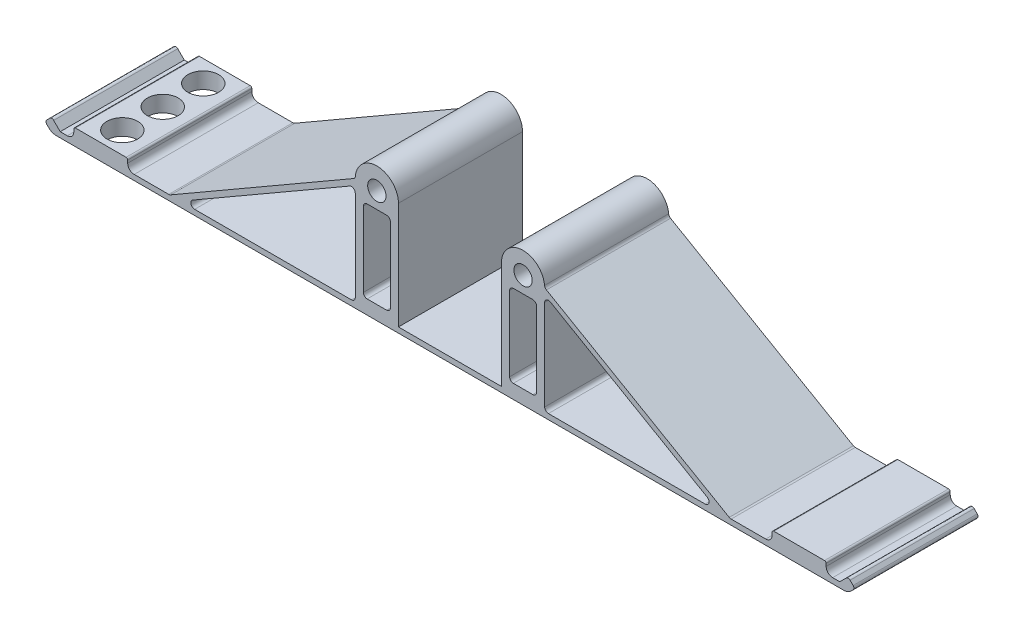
ISO-10303-21;
HEADER;
FILE_DESCRIPTION(('STEP AP214'),'2;1');
FILE_NAME('part.step','',(''),(''),'','','');
FILE_SCHEMA(('AUTOMOTIVE_DESIGN { 1 0 10303 214 1 1 1 1 }'));
ENDSEC;
DATA;
#1=APPLICATION_CONTEXT('core data for automotive mechanical design processes');
#2=APPLICATION_PROTOCOL_DEFINITION('international standard','automotive_design',2000,#1);
#3=PRODUCT_CONTEXT('',#1,'mechanical');
#4=PRODUCT('Part','Part','',(#3));
#5=PRODUCT_RELATED_PRODUCT_CATEGORY('part','',(#4));
#6=PRODUCT_DEFINITION_FORMATION('','',#4);
#7=PRODUCT_DEFINITION_CONTEXT('part definition',#1,'design');
#8=PRODUCT_DEFINITION('design','',#6,#7);
#9=PRODUCT_DEFINITION_SHAPE('','',#8);
#10=(LENGTH_UNIT() NAMED_UNIT(*) SI_UNIT(.MILLI.,.METRE.));
#11=(NAMED_UNIT(*) PLANE_ANGLE_UNIT() SI_UNIT($,.RADIAN.));
#12=(NAMED_UNIT(*) SI_UNIT($,.STERADIAN.) SOLID_ANGLE_UNIT());
#13=UNCERTAINTY_MEASURE_WITH_UNIT(LENGTH_MEASURE(1.E-05),#10,'distance_accuracy_value','');
#14=(GEOMETRIC_REPRESENTATION_CONTEXT(3) GLOBAL_UNCERTAINTY_ASSIGNED_CONTEXT((#13)) GLOBAL_UNIT_ASSIGNED_CONTEXT((#10,
#11,#12)) REPRESENTATION_CONTEXT('',''));
#15=CARTESIAN_POINT('',(0.,0.,0.));
#16=DIRECTION('',(0.,0.,1.));
#17=DIRECTION('',(1.,0.,0.));
#18=AXIS2_PLACEMENT_3D('',#15,#16,#17);
#19=CARTESIAN_POINT('',(0.,-94.,23.));
#20=DIRECTION('',(0.,1.,0.));
#21=DIRECTION('',(0.,0.,1.));
#22=AXIS2_PLACEMENT_3D('',#19,#20,#21);
#23=PLANE('',#22);
#24=DIRECTION('',(1.,0.,0.));
#25=VECTOR('',#24,1.);
#26=CARTESIAN_POINT('',(0.,-94.,0.));
#27=LINE('',#26,#25);
#28=CARTESIAN_POINT('',(70.9261363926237,-94.,0.));
#29=VERTEX_POINT('',#28);
#30=CARTESIAN_POINT('',(72.241212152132,-94.,0.));
#31=VERTEX_POINT('',#30);
#32=EDGE_CURVE('E860',#29,#31,#27,.T.);
#33=ORIENTED_EDGE('',*,*,#32,.F.);
#34=DIRECTION('',(0.,0.,1.));
#35=VECTOR('',#34,1.);
#36=CARTESIAN_POINT('',(70.9261363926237,-94.,23.));
#37=LINE('',#36,#35);
#38=CARTESIAN_POINT('',(70.9261363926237,-94.,23.));
#39=VERTEX_POINT('',#38);
#40=EDGE_CURVE('E835',#29,#39,#37,.T.);
#41=ORIENTED_EDGE('',*,*,#40,.T.);
#42=DIRECTION('',(1.,0.,0.));
#43=VECTOR('',#42,1.);
#44=CARTESIAN_POINT('',(0.,-94.,23.));
#45=LINE('',#44,#43);
#46=CARTESIAN_POINT('',(72.241212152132,-94.,23.));
#47=VERTEX_POINT('',#46);
#48=EDGE_CURVE('E883',#39,#47,#45,.T.);
#49=ORIENTED_EDGE('',*,*,#48,.T.);
#50=DIRECTION('',(0.,0.,-1.));
#51=VECTOR('',#50,1.);
#52=CARTESIAN_POINT('',(72.241212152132,-94.,23.));
#53=LINE('',#52,#51);
#54=EDGE_CURVE('E870',#47,#31,#53,.T.);
#55=ORIENTED_EDGE('',*,*,#54,.T.);
#56=EDGE_LOOP('',(#33,#41,#49,#55));
#57=FACE_BOUND('',#56,.T.);
#58=ADVANCED_FACE('F48',(#57),#23,.T.);
#59=CARTESIAN_POINT('',(-72.241212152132,-94.,23.));
#60=VERTEX_POINT('',#59);
#61=CARTESIAN_POINT('',(-70.9261363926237,-94.,23.));
#62=VERTEX_POINT('',#61);
#63=EDGE_CURVE('E1042',#60,#62,#45,.T.);
#64=ORIENTED_EDGE('',*,*,#63,.T.);
#65=DIRECTION('',(0.,0.,1.));
#66=VECTOR('',#65,1.);
#67=CARTESIAN_POINT('',(-70.9261363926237,-94.,23.));
#68=LINE('',#67,#66);
#69=CARTESIAN_POINT('',(-70.9261363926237,-94.,0.));
#70=VERTEX_POINT('',#69);
#71=EDGE_CURVE('E787',#62,#70,#68,.F.);
#72=ORIENTED_EDGE('',*,*,#71,.T.);
#73=CARTESIAN_POINT('',(-72.241212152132,-94.,0.));
#74=VERTEX_POINT('',#73);
#75=EDGE_CURVE('E1166',#74,#70,#27,.T.);
#76=ORIENTED_EDGE('',*,*,#75,.F.);
#77=DIRECTION('',(0.,0.,-1.));
#78=VECTOR('',#77,1.);
#79=CARTESIAN_POINT('',(-72.241212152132,-94.,23.));
#80=LINE('',#79,#78);
#81=EDGE_CURVE('E1223',#60,#74,#80,.T.);
#82=ORIENTED_EDGE('',*,*,#81,.F.);
#83=EDGE_LOOP('',(#64,#72,#76,#82));
#84=FACE_BOUND('',#83,.T.);
#85=ADVANCED_FACE('F1268',(#84),#23,.T.);
#86=CARTESIAN_POINT('',(-58.5261363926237,-94.,0.));
#87=VERTEX_POINT('',#86);
#88=CARTESIAN_POINT('',(-52.1187729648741,-94.,0.));
#89=VERTEX_POINT('',#88);
#90=EDGE_CURVE('E876',#87,#89,#27,.T.);
#91=ORIENTED_EDGE('',*,*,#90,.F.);
#92=DIRECTION('',(0.,0.,-1.));
#93=VECTOR('',#92,1.);
#94=CARTESIAN_POINT('',(-58.5261363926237,-94.,23.));
#95=LINE('',#94,#93);
#96=CARTESIAN_POINT('',(-58.5261363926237,-94.,23.));
#97=VERTEX_POINT('',#96);
#98=EDGE_CURVE('E794',#87,#97,#95,.F.);
#99=ORIENTED_EDGE('',*,*,#98,.T.);
#100=CARTESIAN_POINT('',(-52.1187729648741,-94.,23.));
#101=VERTEX_POINT('',#100);
#102=EDGE_CURVE('E1036',#97,#101,#45,.T.);
#103=ORIENTED_EDGE('',*,*,#102,.T.);
#104=DIRECTION('',(0.,0.,-1.));
#105=VECTOR('',#104,1.);
#106=CARTESIAN_POINT('',(-52.1187729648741,-94.,0.));
#107=LINE('',#106,#105);
#108=EDGE_CURVE('E516',#101,#89,#107,.T.);
#109=ORIENTED_EDGE('',*,*,#108,.T.);
#110=EDGE_LOOP('',(#91,#99,#103,#109));
#111=FACE_BOUND('',#110,.T.);
#112=ADVANCED_FACE('F1270',(#111),#23,.T.);
#113=CARTESIAN_POINT('',(84.3933982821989,-84.3933982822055,23.));
#114=DIRECTION('',(-0.70710678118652,0.707106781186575,0.));
#115=DIRECTION('',(-0.707106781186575,-0.70710678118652,0.));
#116=AXIS2_PLACEMENT_3D('',#113,#114,#115);
#117=PLANE('',#116);
#118=DIRECTION('',(0.707106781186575,0.70710678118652,0.));
#119=VECTOR('',#118,1.);
#120=CARTESIAN_POINT('',(84.3933982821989,-84.3933982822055,0.));
#121=LINE('',#120,#119);
#122=CARTESIAN_POINT('',(74.3725830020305,-94.4142135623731,0.));
#123=VERTEX_POINT('',#122);
#124=CARTESIAN_POINT('',(74.7261363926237,-94.0606601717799,0.));
#125=VERTEX_POINT('',#124);
#126=EDGE_CURVE('E514',#123,#125,#121,.T.);
#127=ORIENTED_EDGE('',*,*,#126,.T.);
#128=DIRECTION('',(0.,0.,-1.));
#129=VECTOR('',#128,1.);
#130=CARTESIAN_POINT('',(74.7261363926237,-94.0606601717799,23.));
#131=LINE('',#130,#129);
#132=CARTESIAN_POINT('',(74.7261363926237,-94.0606601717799,23.));
#133=VERTEX_POINT('',#132);
#134=EDGE_CURVE('E490',#133,#125,#131,.T.);
#135=ORIENTED_EDGE('',*,*,#134,.F.);
#136=DIRECTION('',(0.707106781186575,0.70710678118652,0.));
#137=VECTOR('',#136,1.);
#138=CARTESIAN_POINT('',(84.3933982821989,-84.3933982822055,23.));
#139=LINE('',#138,#137);
#140=CARTESIAN_POINT('',(74.3725830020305,-94.4142135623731,23.));
#141=VERTEX_POINT('',#140);
#142=EDGE_CURVE('E498',#141,#133,#139,.T.);
#143=ORIENTED_EDGE('',*,*,#142,.F.);
#144=DIRECTION('',(0.,0.,-1.));
#145=VECTOR('',#144,1.);
#146=CARTESIAN_POINT('',(74.3725830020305,-94.4142135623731,23.));
#147=LINE('',#146,#145);
#148=EDGE_CURVE('E1074',#141,#123,#147,.T.);
#149=ORIENTED_EDGE('',*,*,#148,.T.);
#150=EDGE_LOOP('',(#127,#135,#143,#149));
#151=FACE_BOUND('',#150,.T.);
#152=ADVANCED_FACE('F512',(#151),#117,.F.);
#153=CARTESIAN_POINT('',(74.3725830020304,-93.7071067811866,23.));
#154=DIRECTION('',(0.,0.,-1.));
#155=DIRECTION('',(-1.,0.,0.));
#156=AXIS2_PLACEMENT_3D('',#153,#154,#155);
#157=CYLINDRICAL_SURFACE('',#156,0.499999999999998);
#158=CARTESIAN_POINT('',(74.3725830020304,-93.7071067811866,0.));
#159=DIRECTION('',(0.,0.,1.));
#160=DIRECTION('',(1.,0.,0.));
#161=AXIS2_PLACEMENT_3D('',#158,#159,#160);
#162=CIRCLE('',#161,0.499999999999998);
#163=CARTESIAN_POINT('',(74.7261363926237,-93.3535533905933,0.));
#164=VERTEX_POINT('',#163);
#165=EDGE_CURVE('E1128',#125,#164,#162,.T.);
#166=ORIENTED_EDGE('',*,*,#165,.T.);
#167=DIRECTION('',(0.,0.,-1.));
#168=VECTOR('',#167,1.);
#169=CARTESIAN_POINT('',(74.7261363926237,-93.3535533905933,23.));
#170=LINE('',#169,#168);
#171=CARTESIAN_POINT('',(74.7261363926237,-93.3535533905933,23.));
#172=VERTEX_POINT('',#171);
#173=EDGE_CURVE('E493',#172,#164,#170,.T.);
#174=ORIENTED_EDGE('',*,*,#173,.F.);
#175=CARTESIAN_POINT('',(74.3725830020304,-93.7071067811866,23.));
#176=DIRECTION('',(0.,0.,1.));
#177=DIRECTION('',(1.,0.,0.));
#178=AXIS2_PLACEMENT_3D('',#175,#176,#177);
#179=CIRCLE('',#178,0.499999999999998);
#180=EDGE_CURVE('E486',#133,#172,#179,.T.);
#181=ORIENTED_EDGE('',*,*,#180,.F.);
#182=ORIENTED_EDGE('',*,*,#134,.T.);
#183=EDGE_LOOP('',(#166,#174,#181,#182));
#184=FACE_BOUND('',#183,.T.);
#185=ADVANCED_FACE('F488',(#184),#157,.T.);
#186=CARTESIAN_POINT('',(-9.31370849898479,-9.31370849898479,23.));
#187=DIRECTION('',(-0.707106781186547,-0.707106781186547,0.));
#188=DIRECTION('',(0.707106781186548,-0.707106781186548,0.));
#189=AXIS2_PLACEMENT_3D('',#186,#187,#188);
#190=PLANE('',#189);
#191=DIRECTION('',(-0.707106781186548,0.707106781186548,0.));
#192=VECTOR('',#191,1.);
#193=CARTESIAN_POINT('',(-9.31370849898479,-9.31370849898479,0.));
#194=LINE('',#193,#192);
#195=CARTESIAN_POINT('',(74.1604509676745,-92.7878679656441,0.));
#196=VERTEX_POINT('',#195);
#197=EDGE_CURVE('E1131',#164,#196,#194,.T.);
#198=ORIENTED_EDGE('',*,*,#197,.T.);
#199=DIRECTION('',(0.,0.,-1.));
#200=VECTOR('',#199,1.);
#201=CARTESIAN_POINT('',(74.1604509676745,-92.7878679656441,23.));
#202=LINE('',#201,#200);
#203=CARTESIAN_POINT('',(74.1604509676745,-92.7878679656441,23.));
#204=VERTEX_POINT('',#203);
#205=EDGE_CURVE('E523',#204,#196,#202,.T.);
#206=ORIENTED_EDGE('',*,*,#205,.F.);
#207=DIRECTION('',(-0.707106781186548,0.707106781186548,0.));
#208=VECTOR('',#207,1.);
#209=CARTESIAN_POINT('',(-9.31370849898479,-9.31370849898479,23.));
#210=LINE('',#209,#208);
#211=EDGE_CURVE('E497',#172,#204,#210,.T.);
#212=ORIENTED_EDGE('',*,*,#211,.F.);
#213=ORIENTED_EDGE('',*,*,#173,.T.);
#214=EDGE_LOOP('',(#198,#206,#212,#213));
#215=FACE_BOUND('',#214,.T.);
#216=ADVANCED_FACE('F1258',(#215),#190,.F.);
#217=CARTESIAN_POINT('',(73.8068975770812,-93.1414213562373,23.));
#218=DIRECTION('',(0.,0.,-1.));
#219=DIRECTION('',(-1.,0.,0.));
#220=AXIS2_PLACEMENT_3D('',#217,#218,#219);
#221=CYLINDRICAL_SURFACE('',#220,0.499999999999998);
#222=CARTESIAN_POINT('',(73.8068975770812,-93.1414213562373,0.));
#223=DIRECTION('',(0.,0.,1.));
#224=DIRECTION('',(1.,0.,0.));
#225=AXIS2_PLACEMENT_3D('',#222,#223,#224);
#226=CIRCLE('',#225,0.499999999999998);
#227=CARTESIAN_POINT('',(73.4533441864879,-92.7878679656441,0.));
#228=VERTEX_POINT('',#227);
#229=EDGE_CURVE('E1134',#196,#228,#226,.T.);
#230=ORIENTED_EDGE('',*,*,#229,.T.);
#231=DIRECTION('',(0.,0.,-1.));
#232=VECTOR('',#231,1.);
#233=CARTESIAN_POINT('',(73.4533441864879,-92.7878679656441,23.));
#234=LINE('',#233,#232);
#235=CARTESIAN_POINT('',(73.4533441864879,-92.7878679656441,23.));
#236=VERTEX_POINT('',#235);
#237=EDGE_CURVE('E1242',#236,#228,#234,.T.);
#238=ORIENTED_EDGE('',*,*,#237,.F.);
#239=CARTESIAN_POINT('',(73.8068975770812,-93.1414213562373,23.));
#240=DIRECTION('',(0.,0.,1.));
#241=DIRECTION('',(1.,0.,0.));
#242=AXIS2_PLACEMENT_3D('',#239,#240,#241);
#243=CIRCLE('',#242,0.499999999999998);
#244=EDGE_CURVE('E1008',#204,#236,#243,.T.);
#245=ORIENTED_EDGE('',*,*,#244,.F.);
#246=ORIENTED_EDGE('',*,*,#205,.T.);
#247=EDGE_LOOP('',(#230,#238,#245,#246));
#248=FACE_BOUND('',#247,.T.);
#249=ADVANCED_FACE('F1251',(#248),#221,.T.);
#250=CARTESIAN_POINT('',(83.1206060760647,-83.1206060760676,23.));
#251=DIRECTION('',(0.707106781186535,-0.70710678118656,0.));
#252=DIRECTION('',(0.70710678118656,0.707106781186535,0.));
#253=AXIS2_PLACEMENT_3D('',#250,#251,#252);
#254=PLANE('',#253);
#255=DIRECTION('',(-0.70710678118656,-0.707106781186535,0.));
#256=VECTOR('',#255,1.);
#257=CARTESIAN_POINT('',(83.1206060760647,-83.1206060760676,0.));
#258=LINE('',#257,#256);
#259=EDGE_CURVE('E874',#228,#31,#258,.T.);
#260=ORIENTED_EDGE('',*,*,#259,.T.);
#261=ORIENTED_EDGE('',*,*,#54,.F.);
#262=DIRECTION('',(-0.70710678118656,-0.707106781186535,0.));
#263=VECTOR('',#262,1.);
#264=CARTESIAN_POINT('',(83.1206060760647,-83.1206060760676,23.));
#265=LINE('',#264,#263);
#266=EDGE_CURVE('E1011',#236,#47,#265,.T.);
#267=ORIENTED_EDGE('',*,*,#266,.F.);
#268=ORIENTED_EDGE('',*,*,#237,.T.);
#269=EDGE_LOOP('',(#260,#261,#267,#268));
#270=FACE_BOUND('',#269,.T.);
#271=ADVANCED_FACE('F1256',(#270),#254,.F.);
#272=CARTESIAN_POINT('',(52.1187729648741,-94.,23.));
#273=VERTEX_POINT('',#272);
#274=CARTESIAN_POINT('',(58.5261363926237,-94.,23.));
#275=VERTEX_POINT('',#274);
#276=EDGE_CURVE('E1019',#273,#275,#45,.T.);
#277=ORIENTED_EDGE('',*,*,#276,.T.);
#278=DIRECTION('',(0.,0.,-1.));
#279=VECTOR('',#278,1.);
#280=CARTESIAN_POINT('',(58.5261363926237,-94.,0.));
#281=LINE('',#280,#279);
#282=CARTESIAN_POINT('',(58.5261363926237,-94.,0.));
#283=VERTEX_POINT('',#282);
#284=EDGE_CURVE('E842',#275,#283,#281,.T.);
#285=ORIENTED_EDGE('',*,*,#284,.T.);
#286=CARTESIAN_POINT('',(52.1187729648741,-94.,0.));
#287=VERTEX_POINT('',#286);
#288=EDGE_CURVE('E873',#287,#283,#27,.T.);
#289=ORIENTED_EDGE('',*,*,#288,.F.);
#290=DIRECTION('',(0.,0.,-1.));
#291=VECTOR('',#290,1.);
#292=CARTESIAN_POINT('',(52.1187729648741,-94.,23.));
#293=LINE('',#292,#291);
#294=EDGE_CURVE('E547',#287,#273,#293,.F.);
#295=ORIENTED_EDGE('',*,*,#294,.T.);
#296=EDGE_LOOP('',(#277,#285,#289,#295));
#297=FACE_BOUND('',#296,.T.);
#298=ADVANCED_FACE('F1304',(#297),#23,.T.);
#299=CARTESIAN_POINT('',(-27.7203918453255,-48.0131270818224,23.));
#300=DIRECTION('',(-0.499999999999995,-0.866025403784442,0.));
#301=DIRECTION('',(0.866025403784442,-0.499999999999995,0.));
#302=AXIS2_PLACEMENT_3D('',#299,#300,#301);
#303=PLANE('',#302);
#304=DIRECTION('',(-0.866025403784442,0.499999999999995,0.));
#305=VECTOR('',#304,1.);
#306=CARTESIAN_POINT('',(-27.7203918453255,-48.0131270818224,0.));
#307=LINE('',#306,#305);
#308=CARTESIAN_POINT('',(51.7687729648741,-93.9062177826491,0.));
#309=VERTEX_POINT('',#308);
#310=CARTESIAN_POINT('',(17.8816662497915,-74.3414875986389,0.));
#311=VERTEX_POINT('',#310);
#312=EDGE_CURVE('E1139',#309,#311,#307,.T.);
#313=ORIENTED_EDGE('',*,*,#312,.T.);
#314=DIRECTION('',(0.,0.,1.));
#315=VECTOR('',#314,1.);
#316=CARTESIAN_POINT('',(17.8816662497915,-74.3414875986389,23.));
#317=LINE('',#316,#315);
#318=CARTESIAN_POINT('',(17.8816662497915,-74.3414875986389,23.));
#319=VERTEX_POINT('',#318);
#320=EDGE_CURVE('E544',#311,#319,#317,.T.);
#321=ORIENTED_EDGE('',*,*,#320,.T.);
#322=DIRECTION('',(-0.866025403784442,0.499999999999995,0.));
#323=VECTOR('',#322,1.);
#324=CARTESIAN_POINT('',(-27.7203918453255,-48.0131270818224,23.));
#325=LINE('',#324,#323);
#326=CARTESIAN_POINT('',(51.7687729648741,-93.9062177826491,23.));
#327=VERTEX_POINT('',#326);
#328=EDGE_CURVE('E1014',#327,#319,#325,.T.);
#329=ORIENTED_EDGE('',*,*,#328,.F.);
#330=DIRECTION('',(0.,0.,-1.));
#331=VECTOR('',#330,1.);
#332=CARTESIAN_POINT('',(51.7687729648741,-93.9062177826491,23.));
#333=LINE('',#332,#331);
#334=EDGE_CURVE('E540',#327,#309,#333,.T.);
#335=ORIENTED_EDGE('',*,*,#334,.T.);
#336=EDGE_LOOP('',(#313,#321,#329,#335));
#337=FACE_BOUND('',#336,.T.);
#338=ADVANCED_FACE('F1313',(#337),#303,.F.);
#339=CARTESIAN_POINT('',(13.55,-74.1500000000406,23.));
#340=DIRECTION('',(0.,0.,-1.));
#341=DIRECTION('',(-1.,0.,0.));
#342=AXIS2_PLACEMENT_3D('',#339,#340,#341);
#343=CYLINDRICAL_SURFACE('',#342,4.);
#344=CARTESIAN_POINT('',(13.55,-74.1500000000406,23.));
#345=DIRECTION('',(0.,0.,1.));
#346=DIRECTION('',(1.,0.,0.));
#347=AXIS2_PLACEMENT_3D('',#344,#345,#346);
#348=CIRCLE('',#347,4.);
#349=CARTESIAN_POINT('',(17.5343968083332,-73.7970381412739,23.));
#350=VERTEX_POINT('',#349);
#351=CARTESIAN_POINT('',(9.54999999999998,-74.1500000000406,23.));
#352=VERTEX_POINT('',#351);
#353=EDGE_CURVE('E1018',#350,#352,#348,.T.);
#354=ORIENTED_EDGE('',*,*,#353,.F.);
#355=DIRECTION('',(0.,0.,-1.));
#356=VECTOR('',#355,1.);
#357=CARTESIAN_POINT('',(17.5343968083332,-73.7970381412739,23.));
#358=LINE('',#357,#356);
#359=CARTESIAN_POINT('',(17.5343968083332,-73.7970381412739,0.));
#360=VERTEX_POINT('',#359);
#361=EDGE_CURVE('E536',#350,#360,#358,.T.);
#362=ORIENTED_EDGE('',*,*,#361,.T.);
#363=CARTESIAN_POINT('',(13.55,-74.1500000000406,0.));
#364=DIRECTION('',(0.,0.,1.));
#365=DIRECTION('',(1.,0.,0.));
#366=AXIS2_PLACEMENT_3D('',#363,#364,#365);
#367=CIRCLE('',#366,4.);
#368=CARTESIAN_POINT('',(9.54999999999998,-74.1500000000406,0.));
#369=VERTEX_POINT('',#368);
#370=EDGE_CURVE('E1143',#360,#369,#367,.T.);
#371=ORIENTED_EDGE('',*,*,#370,.T.);
#372=DIRECTION('',(0.,0.,-1.));
#373=VECTOR('',#372,1.);
#374=CARTESIAN_POINT('',(9.54999999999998,-74.1500000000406,23.));
#375=LINE('',#374,#373);
#376=EDGE_CURVE('E1236',#352,#369,#375,.T.);
#377=ORIENTED_EDGE('',*,*,#376,.F.);
#378=EDGE_LOOP('',(#354,#362,#371,#377));
#379=FACE_BOUND('',#378,.T.);
#380=ADVANCED_FACE('F1319',(#379),#343,.T.);
#381=CARTESIAN_POINT('',(9.54999999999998,0.,23.));
#382=DIRECTION('',(1.,0.,0.));
#383=DIRECTION('',(0.,0.,-1.));
#384=AXIS2_PLACEMENT_3D('',#381,#382,#383);
#385=PLANE('',#384);
#386=DIRECTION('',(0.,-1.,0.));
#387=VECTOR('',#386,1.);
#388=CARTESIAN_POINT('',(9.54999999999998,0.,0.));
#389=LINE('',#388,#387);
#390=CARTESIAN_POINT('',(9.54999999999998,-94.,0.));
#391=VERTEX_POINT('',#390);
#392=EDGE_CURVE('E1146',#369,#391,#389,.T.);
#393=ORIENTED_EDGE('',*,*,#392,.T.);
#394=DIRECTION('',(0.,0.,-1.));
#395=VECTOR('',#394,1.);
#396=CARTESIAN_POINT('',(9.54999999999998,-94.,23.));
#397=LINE('',#396,#395);
#398=CARTESIAN_POINT('',(9.54999999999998,-94.,23.));
#399=VERTEX_POINT('',#398);
#400=EDGE_CURVE('E1233',#399,#391,#397,.T.);
#401=ORIENTED_EDGE('',*,*,#400,.F.);
#402=DIRECTION('',(0.,-1.,0.));
#403=VECTOR('',#402,1.);
#404=CARTESIAN_POINT('',(9.54999999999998,0.,23.));
#405=LINE('',#404,#403);
#406=EDGE_CURVE('E1022',#352,#399,#405,.T.);
#407=ORIENTED_EDGE('',*,*,#406,.F.);
#408=ORIENTED_EDGE('',*,*,#376,.T.);
#409=EDGE_LOOP('',(#393,#401,#407,#408));
#410=FACE_BOUND('',#409,.T.);
#411=ADVANCED_FACE('F1326',(#410),#385,.F.);
#412=CARTESIAN_POINT('',(-9.54999999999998,-94.,0.));
#413=VERTEX_POINT('',#412);
#414=EDGE_CURVE('E1101',#413,#391,#27,.T.);
#415=ORIENTED_EDGE('',*,*,#414,.F.);
#416=DIRECTION('',(0.,0.,-1.));
#417=VECTOR('',#416,1.);
#418=CARTESIAN_POINT('',(-9.54999999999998,-94.,23.));
#419=LINE('',#418,#417);
#420=CARTESIAN_POINT('',(-9.54999999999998,-94.,23.));
#421=VERTEX_POINT('',#420);
#422=EDGE_CURVE('E1230',#421,#413,#419,.T.);
#423=ORIENTED_EDGE('',*,*,#422,.F.);
#424=EDGE_CURVE('E982',#421,#399,#45,.T.);
#425=ORIENTED_EDGE('',*,*,#424,.T.);
#426=ORIENTED_EDGE('',*,*,#400,.T.);
#427=EDGE_LOOP('',(#415,#423,#425,#426));
#428=FACE_BOUND('',#427,.T.);
#429=ADVANCED_FACE('F1275',(#428),#23,.T.);
#430=CARTESIAN_POINT('',(-9.54999999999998,0.,23.));
#431=DIRECTION('',(1.,0.,0.));
#432=DIRECTION('',(0.,0.,-1.));
#433=AXIS2_PLACEMENT_3D('',#430,#431,#432);
#434=PLANE('',#433);
#435=DIRECTION('',(0.,-1.,0.));
#436=VECTOR('',#435,1.);
#437=CARTESIAN_POINT('',(-9.54999999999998,0.,0.));
#438=LINE('',#437,#436);
#439=CARTESIAN_POINT('',(-9.54999999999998,-74.1500000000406,0.));
#440=VERTEX_POINT('',#439);
#441=EDGE_CURVE('E1150',#440,#413,#438,.T.);
#442=ORIENTED_EDGE('',*,*,#441,.F.);
#443=DIRECTION('',(0.,0.,-1.));
#444=VECTOR('',#443,1.);
#445=CARTESIAN_POINT('',(-9.54999999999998,-74.1500000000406,23.));
#446=LINE('',#445,#444);
#447=CARTESIAN_POINT('',(-9.54999999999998,-74.1500000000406,23.));
#448=VERTEX_POINT('',#447);
#449=EDGE_CURVE('E1226',#448,#440,#446,.T.);
#450=ORIENTED_EDGE('',*,*,#449,.F.);
#451=DIRECTION('',(0.,-1.,0.));
#452=VECTOR('',#451,1.);
#453=CARTESIAN_POINT('',(-9.54999999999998,0.,23.));
#454=LINE('',#453,#452);
#455=EDGE_CURVE('E1025',#448,#421,#454,.T.);
#456=ORIENTED_EDGE('',*,*,#455,.T.);
#457=ORIENTED_EDGE('',*,*,#422,.T.);
#458=EDGE_LOOP('',(#442,#450,#456,#457));
#459=FACE_BOUND('',#458,.T.);
#460=ADVANCED_FACE('F1325',(#459),#434,.T.);
#461=CARTESIAN_POINT('',(-13.55,-74.1500000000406,23.));
#462=DIRECTION('',(0.,0.,-1.));
#463=DIRECTION('',(-1.,0.,0.));
#464=AXIS2_PLACEMENT_3D('',#461,#462,#463);
#465=CYLINDRICAL_SURFACE('',#464,4.);
#466=CARTESIAN_POINT('',(-13.55,-74.1500000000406,0.));
#467=DIRECTION('',(0.,0.,1.));
#468=DIRECTION('',(1.,0.,0.));
#469=AXIS2_PLACEMENT_3D('',#466,#467,#468);
#470=CIRCLE('',#469,4.);
#471=CARTESIAN_POINT('',(-17.5343968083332,-73.7970381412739,0.));
#472=VERTEX_POINT('',#471);
#473=EDGE_CURVE('E1154',#472,#440,#470,.F.);
#474=ORIENTED_EDGE('',*,*,#473,.F.);
#475=DIRECTION('',(0.,0.,-1.));
#476=VECTOR('',#475,1.);
#477=CARTESIAN_POINT('',(-17.5343968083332,-73.7970381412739,23.));
#478=LINE('',#477,#476);
#479=CARTESIAN_POINT('',(-17.5343968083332,-73.7970381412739,23.));
#480=VERTEX_POINT('',#479);
#481=EDGE_CURVE('E533',#472,#480,#478,.F.);
#482=ORIENTED_EDGE('',*,*,#481,.T.);
#483=CARTESIAN_POINT('',(-13.55,-74.1500000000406,23.));
#484=DIRECTION('',(0.,0.,1.));
#485=DIRECTION('',(1.,0.,0.));
#486=AXIS2_PLACEMENT_3D('',#483,#484,#485);
#487=CIRCLE('',#486,4.);
#488=EDGE_CURVE('E1029',#480,#448,#487,.F.);
#489=ORIENTED_EDGE('',*,*,#488,.T.);
#490=ORIENTED_EDGE('',*,*,#449,.T.);
#491=EDGE_LOOP('',(#474,#482,#489,#490));
#492=FACE_BOUND('',#491,.T.);
#493=ADVANCED_FACE('F1332',(#492),#465,.T.);
#494=CARTESIAN_POINT('',(27.7203918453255,-48.0131270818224,23.));
#495=DIRECTION('',(-0.499999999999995,0.866025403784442,0.));
#496=DIRECTION('',(-0.866025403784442,-0.499999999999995,0.));
#497=AXIS2_PLACEMENT_3D('',#494,#495,#496);
#498=PLANE('',#497);
#499=DIRECTION('',(0.866025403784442,0.499999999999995,0.));
#500=VECTOR('',#499,1.);
#501=CARTESIAN_POINT('',(27.7203918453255,-48.0131270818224,0.));
#502=LINE('',#501,#500);
#503=CARTESIAN_POINT('',(-51.7687729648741,-93.9062177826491,0.));
#504=VERTEX_POINT('',#503);
#505=CARTESIAN_POINT('',(-17.8816662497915,-74.3414875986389,0.));
#506=VERTEX_POINT('',#505);
#507=EDGE_CURVE('E1157',#504,#506,#502,.T.);
#508=ORIENTED_EDGE('',*,*,#507,.F.);
#509=DIRECTION('',(0.,0.,-1.));
#510=VECTOR('',#509,1.);
#511=CARTESIAN_POINT('',(-51.7687729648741,-93.9062177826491,23.));
#512=LINE('',#511,#510);
#513=CARTESIAN_POINT('',(-51.7687729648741,-93.9062177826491,23.));
#514=VERTEX_POINT('',#513);
#515=EDGE_CURVE('E530',#504,#514,#512,.F.);
#516=ORIENTED_EDGE('',*,*,#515,.T.);
#517=DIRECTION('',(0.866025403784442,0.499999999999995,0.));
#518=VECTOR('',#517,1.);
#519=CARTESIAN_POINT('',(27.7203918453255,-48.0131270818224,23.));
#520=LINE('',#519,#518);
#521=CARTESIAN_POINT('',(-17.8816662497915,-74.3414875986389,23.));
#522=VERTEX_POINT('',#521);
#523=EDGE_CURVE('E1032',#514,#522,#520,.T.);
#524=ORIENTED_EDGE('',*,*,#523,.T.);
#525=DIRECTION('',(0.,0.,1.));
#526=VECTOR('',#525,1.);
#527=CARTESIAN_POINT('',(-17.8816662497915,-74.3414875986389,0.));
#528=LINE('',#527,#526);
#529=EDGE_CURVE('E521',#522,#506,#528,.F.);
#530=ORIENTED_EDGE('',*,*,#529,.T.);
#531=EDGE_LOOP('',(#508,#516,#524,#530));
#532=FACE_BOUND('',#531,.T.);
#533=ADVANCED_FACE('F1438',(#532),#498,.T.);
#534=CARTESIAN_POINT('',(-83.1206060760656,-83.1206060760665,23.));
#535=DIRECTION('',(0.707106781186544,0.707106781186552,0.));
#536=DIRECTION('',(-0.707106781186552,0.707106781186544,0.));
#537=AXIS2_PLACEMENT_3D('',#534,#535,#536);
#538=PLANE('',#537);
#539=DIRECTION('',(0.707106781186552,-0.707106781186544,0.));
#540=VECTOR('',#539,1.);
#541=CARTESIAN_POINT('',(-83.1206060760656,-83.1206060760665,0.));
#542=LINE('',#541,#540);
#543=CARTESIAN_POINT('',(-73.4533441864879,-92.7878679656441,0.));
#544=VERTEX_POINT('',#543);
#545=EDGE_CURVE('E1161',#544,#74,#542,.T.);
#546=ORIENTED_EDGE('',*,*,#545,.F.);
#547=DIRECTION('',(0.,0.,-1.));
#548=VECTOR('',#547,1.);
#549=CARTESIAN_POINT('',(-73.4533441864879,-92.7878679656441,23.));
#550=LINE('',#549,#548);
#551=CARTESIAN_POINT('',(-73.4533441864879,-92.7878679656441,23.));
#552=VERTEX_POINT('',#551);
#553=EDGE_CURVE('E1220',#552,#544,#550,.T.);
#554=ORIENTED_EDGE('',*,*,#553,.F.);
#555=DIRECTION('',(0.707106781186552,-0.707106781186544,0.));
#556=VECTOR('',#555,1.);
#557=CARTESIAN_POINT('',(-83.1206060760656,-83.1206060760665,23.));
#558=LINE('',#557,#556);
#559=EDGE_CURVE('E1037',#552,#60,#558,.T.);
#560=ORIENTED_EDGE('',*,*,#559,.T.);
#561=ORIENTED_EDGE('',*,*,#81,.T.);
#562=EDGE_LOOP('',(#546,#554,#560,#561));
#563=FACE_BOUND('',#562,.T.);
#564=ADVANCED_FACE('F1450',(#563),#538,.T.);
#565=CARTESIAN_POINT('',(-73.8068975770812,-93.1414213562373,23.));
#566=DIRECTION('',(0.,0.,-1.));
#567=DIRECTION('',(-1.,0.,0.));
#568=AXIS2_PLACEMENT_3D('',#565,#566,#567);
#569=CYLINDRICAL_SURFACE('',#568,0.499999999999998);
#570=CARTESIAN_POINT('',(-73.8068975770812,-93.1414213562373,0.));
#571=DIRECTION('',(0.,0.,1.));
#572=DIRECTION('',(1.,0.,0.));
#573=AXIS2_PLACEMENT_3D('',#570,#571,#572);
#574=CIRCLE('',#573,0.499999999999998);
#575=CARTESIAN_POINT('',(-74.1604509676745,-92.7878679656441,0.));
#576=VERTEX_POINT('',#575);
#577=EDGE_CURVE('E1165',#576,#544,#574,.F.);
#578=ORIENTED_EDGE('',*,*,#577,.F.);
#579=DIRECTION('',(0.,0.,-1.));
#580=VECTOR('',#579,1.);
#581=CARTESIAN_POINT('',(-74.1604509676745,-92.7878679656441,23.));
#582=LINE('',#581,#580);
#583=CARTESIAN_POINT('',(-74.1604509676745,-92.7878679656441,23.));
#584=VERTEX_POINT('',#583);
#585=EDGE_CURVE('E1217',#584,#576,#582,.T.);
#586=ORIENTED_EDGE('',*,*,#585,.F.);
#587=CARTESIAN_POINT('',(-73.8068975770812,-93.1414213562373,23.));
#588=DIRECTION('',(0.,0.,1.));
#589=DIRECTION('',(1.,0.,0.));
#590=AXIS2_PLACEMENT_3D('',#587,#588,#589);
#591=CIRCLE('',#590,0.499999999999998);
#592=EDGE_CURVE('E1041',#584,#552,#591,.F.);
#593=ORIENTED_EDGE('',*,*,#592,.T.);
#594=ORIENTED_EDGE('',*,*,#553,.T.);
#595=EDGE_LOOP('',(#578,#586,#593,#594));
#596=FACE_BOUND('',#595,.T.);
#597=ADVANCED_FACE('F2186',(#596),#569,.T.);
#598=CARTESIAN_POINT('',(9.31370849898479,-9.31370849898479,23.));
#599=DIRECTION('',(-0.707106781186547,0.707106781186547,0.));
#600=DIRECTION('',(-0.707106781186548,-0.707106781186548,0.));
#601=AXIS2_PLACEMENT_3D('',#598,#599,#600);
#602=PLANE('',#601);
#603=DIRECTION('',(0.707106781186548,0.707106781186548,0.));
#604=VECTOR('',#603,1.);
#605=CARTESIAN_POINT('',(9.31370849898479,-9.31370849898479,0.));
#606=LINE('',#605,#604);
#607=CARTESIAN_POINT('',(-74.7261363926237,-93.3535533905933,0.));
#608=VERTEX_POINT('',#607);
#609=EDGE_CURVE('E1170',#608,#576,#606,.T.);
#610=ORIENTED_EDGE('',*,*,#609,.F.);
#611=DIRECTION('',(0.,0.,-1.));
#612=VECTOR('',#611,1.);
#613=CARTESIAN_POINT('',(-74.7261363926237,-93.3535533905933,23.));
#614=LINE('',#613,#612);
#615=CARTESIAN_POINT('',(-74.7261363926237,-93.3535533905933,23.));
#616=VERTEX_POINT('',#615);
#617=EDGE_CURVE('E1214',#616,#608,#614,.T.);
#618=ORIENTED_EDGE('',*,*,#617,.F.);
#619=DIRECTION('',(0.707106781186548,0.707106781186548,0.));
#620=VECTOR('',#619,1.);
#621=CARTESIAN_POINT('',(9.31370849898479,-9.31370849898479,23.));
#622=LINE('',#621,#620);
#623=EDGE_CURVE('E1046',#616,#584,#622,.T.);
#624=ORIENTED_EDGE('',*,*,#623,.T.);
#625=ORIENTED_EDGE('',*,*,#585,.T.);
#626=EDGE_LOOP('',(#610,#618,#624,#625));
#627=FACE_BOUND('',#626,.T.);
#628=ADVANCED_FACE('F2196',(#627),#602,.T.);
#629=CARTESIAN_POINT('',(-74.3725830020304,-93.7071067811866,23.));
#630=DIRECTION('',(0.,0.,-1.));
#631=DIRECTION('',(-1.,0.,0.));
#632=AXIS2_PLACEMENT_3D('',#629,#630,#631);
#633=CYLINDRICAL_SURFACE('',#632,0.499999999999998);
#634=CARTESIAN_POINT('',(-74.3725830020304,-93.7071067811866,0.));
#635=DIRECTION('',(0.,0.,1.));
#636=DIRECTION('',(1.,0.,0.));
#637=AXIS2_PLACEMENT_3D('',#634,#635,#636);
#638=CIRCLE('',#637,0.499999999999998);
#639=CARTESIAN_POINT('',(-74.7261363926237,-94.0606601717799,0.));
#640=VERTEX_POINT('',#639);
#641=EDGE_CURVE('E1174',#640,#608,#638,.F.);
#642=ORIENTED_EDGE('',*,*,#641,.F.);
#643=DIRECTION('',(0.,0.,-1.));
#644=VECTOR('',#643,1.);
#645=CARTESIAN_POINT('',(-74.7261363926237,-94.0606601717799,23.));
#646=LINE('',#645,#644);
#647=CARTESIAN_POINT('',(-74.7261363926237,-94.0606601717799,23.));
#648=VERTEX_POINT('',#647);
#649=EDGE_CURVE('E1211',#648,#640,#646,.T.);
#650=ORIENTED_EDGE('',*,*,#649,.F.);
#651=CARTESIAN_POINT('',(-74.3725830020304,-93.7071067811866,23.));
#652=DIRECTION('',(0.,0.,1.));
#653=DIRECTION('',(1.,0.,0.));
#654=AXIS2_PLACEMENT_3D('',#651,#652,#653);
#655=CIRCLE('',#654,0.499999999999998);
#656=EDGE_CURVE('E1050',#648,#616,#655,.F.);
#657=ORIENTED_EDGE('',*,*,#656,.T.);
#658=ORIENTED_EDGE('',*,*,#617,.T.);
#659=EDGE_LOOP('',(#642,#650,#657,#658));
#660=FACE_BOUND('',#659,.T.);
#661=ADVANCED_FACE('F2207',(#660),#633,.T.);
#662=CARTESIAN_POINT('',(-84.3933982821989,-84.3933982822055,23.));
#663=DIRECTION('',(-0.70710678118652,-0.707106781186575,0.));
#664=DIRECTION('',(0.707106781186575,-0.70710678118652,0.));
#665=AXIS2_PLACEMENT_3D('',#662,#663,#664);
#666=PLANE('',#665);
#667=DIRECTION('',(-0.707106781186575,0.70710678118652,0.));
#668=VECTOR('',#667,1.);
#669=CARTESIAN_POINT('',(-84.3933982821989,-84.3933982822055,0.));
#670=LINE('',#669,#668);
#671=CARTESIAN_POINT('',(-74.3725830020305,-94.4142135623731,0.));
#672=VERTEX_POINT('',#671);
#673=EDGE_CURVE('E1178',#672,#640,#670,.T.);
#674=ORIENTED_EDGE('',*,*,#673,.F.);
#675=DIRECTION('',(0.,0.,-1.));
#676=VECTOR('',#675,1.);
#677=CARTESIAN_POINT('',(-74.3725830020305,-94.4142135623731,23.));
#678=LINE('',#677,#676);
#679=CARTESIAN_POINT('',(-74.3725830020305,-94.4142135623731,23.));
#680=VERTEX_POINT('',#679);
#681=EDGE_CURVE('E1208',#680,#672,#678,.T.);
#682=ORIENTED_EDGE('',*,*,#681,.F.);
#683=DIRECTION('',(-0.707106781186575,0.70710678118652,0.));
#684=VECTOR('',#683,1.);
#685=CARTESIAN_POINT('',(-84.3933982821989,-84.3933982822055,23.));
#686=LINE('',#685,#684);
#687=EDGE_CURVE('E1054',#680,#648,#686,.T.);
#688=ORIENTED_EDGE('',*,*,#687,.T.);
#689=ORIENTED_EDGE('',*,*,#649,.T.);
#690=EDGE_LOOP('',(#674,#682,#688,#689));
#691=FACE_BOUND('',#690,.T.);
#692=ADVANCED_FACE('F2218',(#691),#666,.T.);
#693=CARTESIAN_POINT('',(-72.9583694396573,-93.,23.));
#694=DIRECTION('',(0.,0.,-1.));
#695=DIRECTION('',(-1.,0.,0.));
#696=AXIS2_PLACEMENT_3D('',#693,#694,#695);
#697=CYLINDRICAL_SURFACE('',#696,2.);
#698=CARTESIAN_POINT('',(-72.9583694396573,-93.,0.));
#699=DIRECTION('',(0.,0.,1.));
#700=DIRECTION('',(1.,0.,0.));
#701=AXIS2_PLACEMENT_3D('',#698,#699,#700);
#702=CIRCLE('',#701,2.);
#703=CARTESIAN_POINT('',(-72.9583694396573,-95.,0.));
#704=VERTEX_POINT('',#703);
#705=EDGE_CURVE('E1182',#672,#704,#702,.T.);
#706=ORIENTED_EDGE('',*,*,#705,.T.);
#707=DIRECTION('',(0.,0.,-1.));
#708=VECTOR('',#707,1.);
#709=CARTESIAN_POINT('',(-72.9583694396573,-95.,23.));
#710=LINE('',#709,#708);
#711=CARTESIAN_POINT('',(-72.9583694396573,-95.,23.));
#712=VERTEX_POINT('',#711);
#713=EDGE_CURVE('E1204',#712,#704,#710,.T.);
#714=ORIENTED_EDGE('',*,*,#713,.F.);
#715=CARTESIAN_POINT('',(-72.9583694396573,-93.,23.));
#716=DIRECTION('',(0.,0.,1.));
#717=DIRECTION('',(1.,0.,0.));
#718=AXIS2_PLACEMENT_3D('',#715,#716,#717);
#719=CIRCLE('',#718,2.);
#720=EDGE_CURVE('E1058',#680,#712,#719,.T.);
#721=ORIENTED_EDGE('',*,*,#720,.F.);
#722=ORIENTED_EDGE('',*,*,#681,.T.);
#723=EDGE_LOOP('',(#706,#714,#721,#722));
#724=FACE_BOUND('',#723,.T.);
#725=ADVANCED_FACE('F2063',(#724),#697,.T.);
#726=CARTESIAN_POINT('',(0.,-95.,23.));
#727=DIRECTION('',(0.,1.,0.));
#728=DIRECTION('',(0.,0.,1.));
#729=AXIS2_PLACEMENT_3D('',#726,#727,#728);
#730=PLANE('',#729);
#731=CARTESIAN_POINT('',(-64.7261363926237,-95.,4.));
#732=DIRECTION('',(0.,-1.,0.));
#733=DIRECTION('',(0.,0.,1.));
#734=AXIS2_PLACEMENT_3D('',#731,#732,#733);
#735=CIRCLE('',#734,2.85);
#736=CARTESIAN_POINT('',(-64.7261363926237,-95.,6.84999999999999));
#737=VERTEX_POINT('',#736);
#738=EDGE_CURVE('E939',#737,#737,#735,.T.);
#739=ORIENTED_EDGE('',*,*,#738,.F.);
#740=EDGE_LOOP('',(#739));
#741=FACE_BOUND('',#740,.T.);
#742=CARTESIAN_POINT('',(-64.7261363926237,-95.,19.));
#743=DIRECTION('',(0.,-1.,0.));
#744=DIRECTION('',(0.,0.,-1.));
#745=AXIS2_PLACEMENT_3D('',#742,#743,#744);
#746=CIRCLE('',#745,2.85);
#747=CARTESIAN_POINT('',(-64.7261363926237,-95.,16.15));
#748=VERTEX_POINT('',#747);
#749=EDGE_CURVE('E940',#748,#748,#746,.T.);
#750=ORIENTED_EDGE('',*,*,#749,.F.);
#751=EDGE_LOOP('',(#750));
#752=FACE_BOUND('',#751,.T.);
#753=CARTESIAN_POINT('',(-64.7261363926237,-95.,11.5));
#754=DIRECTION('',(0.,-1.,0.));
#755=DIRECTION('',(0.,0.,-1.));
#756=AXIS2_PLACEMENT_3D('',#753,#754,#755);
#757=CIRCLE('',#756,2.85);
#758=CARTESIAN_POINT('',(-64.7261363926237,-95.,8.65));
#759=VERTEX_POINT('',#758);
#760=EDGE_CURVE('E944',#759,#759,#757,.T.);
#761=ORIENTED_EDGE('',*,*,#760,.F.);
#762=EDGE_LOOP('',(#761));
#763=FACE_BOUND('',#762,.T.);
#764=DIRECTION('',(1.,0.,0.));
#765=VECTOR('',#764,1.);
#766=CARTESIAN_POINT('',(0.,-95.,0.));
#767=LINE('',#766,#765);
#768=CARTESIAN_POINT('',(72.9583694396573,-95.,0.));
#769=VERTEX_POINT('',#768);
#770=EDGE_CURVE('E1185',#704,#769,#767,.T.);
#771=ORIENTED_EDGE('',*,*,#770,.T.);
#772=DIRECTION('',(0.,0.,-1.));
#773=VECTOR('',#772,1.);
#774=CARTESIAN_POINT('',(72.9583694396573,-95.,23.));
#775=LINE('',#774,#773);
#776=CARTESIAN_POINT('',(72.9583694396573,-95.,23.));
#777=VERTEX_POINT('',#776);
#778=EDGE_CURVE('E1200',#777,#769,#775,.T.);
#779=ORIENTED_EDGE('',*,*,#778,.F.);
#780=DIRECTION('',(1.,0.,0.));
#781=VECTOR('',#780,1.);
#782=CARTESIAN_POINT('',(0.,-95.,23.));
#783=LINE('',#782,#781);
#784=EDGE_CURVE('E1061',#712,#777,#783,.T.);
#785=ORIENTED_EDGE('',*,*,#784,.F.);
#786=ORIENTED_EDGE('',*,*,#713,.T.);
#787=EDGE_LOOP('',(#771,#779,#785,#786));
#788=FACE_BOUND('',#787,.T.);
#789=ADVANCED_FACE('F1599',(#741,#752,#763,#788),#730,.F.);
#790=CARTESIAN_POINT('',(28.2203918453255,-48.8791524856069,23.));
#791=DIRECTION('',(-0.499999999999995,0.866025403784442,0.));
#792=DIRECTION('',(-0.866025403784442,-0.499999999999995,0.));
#793=AXIS2_PLACEMENT_3D('',#790,#791,#792);
#794=PLANE('',#793);
#795=DIRECTION('',(0.866025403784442,0.499999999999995,0.));
#796=VECTOR('',#795,1.);
#797=CARTESIAN_POINT('',(28.2203918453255,-48.8791524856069,23.));
#798=LINE('',#797,#796);
#799=CARTESIAN_POINT('',(-47.668772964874,-92.6937822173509,23.));
#800=VERTEX_POINT('',#799);
#801=CARTESIAN_POINT('',(-18.6,-75.910918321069,23.));
#802=VERTEX_POINT('',#801);
#803=EDGE_CURVE('E998',#800,#802,#798,.T.);
#804=ORIENTED_EDGE('',*,*,#803,.F.);
#805=DIRECTION('',(0.,0.,-1.));
#806=VECTOR('',#805,1.);
#807=CARTESIAN_POINT('',(-47.668772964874,-92.6937822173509,23.));
#808=LINE('',#807,#806);
#809=CARTESIAN_POINT('',(-47.668772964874,-92.6937822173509,0.));
#810=VERTEX_POINT('',#809);
#811=EDGE_CURVE('E553',#800,#810,#808,.T.);
#812=ORIENTED_EDGE('',*,*,#811,.T.);
#813=DIRECTION('',(0.866025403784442,0.499999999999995,0.));
#814=VECTOR('',#813,1.);
#815=CARTESIAN_POINT('',(28.2203918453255,-48.8791524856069,0.));
#816=LINE('',#815,#814);
#817=CARTESIAN_POINT('',(-18.6,-75.910918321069,0.));
#818=VERTEX_POINT('',#817);
#819=EDGE_CURVE('E1117',#810,#818,#816,.T.);
#820=ORIENTED_EDGE('',*,*,#819,.T.);
#821=DIRECTION('',(0.,0.,-1.));
#822=VECTOR('',#821,1.);
#823=CARTESIAN_POINT('',(-18.6,-75.910918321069,23.));
#824=LINE('',#823,#822);
#825=EDGE_CURVE('E550',#818,#802,#824,.F.);
#826=ORIENTED_EDGE('',*,*,#825,.T.);
#827=EDGE_LOOP('',(#804,#812,#820,#826));
#828=FACE_BOUND('',#827,.T.);
#829=ADVANCED_FACE('F1386',(#828),#794,.F.);
#830=CARTESIAN_POINT('',(-17.55,0.,23.));
#831=DIRECTION('',(1.,0.,0.));
#832=DIRECTION('',(0.,0.,-1.));
#833=AXIS2_PLACEMENT_3D('',#830,#831,#832);
#834=PLANE('',#833);
#835=DIRECTION('',(0.,-1.,0.));
#836=VECTOR('',#835,1.);
#837=CARTESIAN_POINT('',(-17.55,0.,0.));
#838=LINE('',#837,#836);
#839=CARTESIAN_POINT('',(-17.55,-76.5171361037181,0.));
#840=VERTEX_POINT('',#839);
#841=CARTESIAN_POINT('',(-17.55,-93.3,0.));
#842=VERTEX_POINT('',#841);
#843=EDGE_CURVE('E1121',#840,#842,#838,.T.);
#844=ORIENTED_EDGE('',*,*,#843,.T.);
#845=DIRECTION('',(0.,0.,-1.));
#846=VECTOR('',#845,1.);
#847=CARTESIAN_POINT('',(-17.55,-93.3,23.));
#848=LINE('',#847,#846);
#849=CARTESIAN_POINT('',(-17.55,-93.3,23.));
#850=VERTEX_POINT('',#849);
#851=EDGE_CURVE('E568',#842,#850,#848,.F.);
#852=ORIENTED_EDGE('',*,*,#851,.T.);
#853=DIRECTION('',(0.,-1.,0.));
#854=VECTOR('',#853,1.);
#855=CARTESIAN_POINT('',(-17.55,0.,23.));
#856=LINE('',#855,#854);
#857=CARTESIAN_POINT('',(-17.55,-76.5171361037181,23.));
#858=VERTEX_POINT('',#857);
#859=EDGE_CURVE('E1002',#858,#850,#856,.T.);
#860=ORIENTED_EDGE('',*,*,#859,.F.);
#861=DIRECTION('',(0.,0.,-1.));
#862=VECTOR('',#861,1.);
#863=CARTESIAN_POINT('',(-17.55,-76.5171361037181,0.));
#864=LINE('',#863,#862);
#865=EDGE_CURVE('E564',#858,#840,#864,.T.);
#866=ORIENTED_EDGE('',*,*,#865,.T.);
#867=EDGE_LOOP('',(#844,#852,#860,#866));
#868=FACE_BOUND('',#867,.T.);
#869=ADVANCED_FACE('F1377',(#868),#834,.F.);
#870=CARTESIAN_POINT('',(0.,-77.1500000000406,23.));
#871=DIRECTION('',(0.,1.,0.));
#872=DIRECTION('',(0.,0.,1.));
#873=AXIS2_PLACEMENT_3D('',#870,#871,#872);
#874=PLANE('',#873);
#875=DIRECTION('',(1.,0.,0.));
#876=VECTOR('',#875,1.);
#877=CARTESIAN_POINT('',(0.,-77.1500000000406,23.));
#878=LINE('',#877,#876);
#879=CARTESIAN_POINT('',(-15.35,-77.1500000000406,23.));
#880=VERTEX_POINT('',#879);
#881=CARTESIAN_POINT('',(-11.75,-77.1500000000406,23.));
#882=VERTEX_POINT('',#881);
#883=EDGE_CURVE('E981',#880,#882,#878,.T.);
#884=ORIENTED_EDGE('',*,*,#883,.F.);
#885=DIRECTION('',(0.,0.,-1.));
#886=VECTOR('',#885,1.);
#887=CARTESIAN_POINT('',(-15.35,-77.1500000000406,23.));
#888=LINE('',#887,#886);
#889=CARTESIAN_POINT('',(-15.35,-77.1500000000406,0.));
#890=VERTEX_POINT('',#889);
#891=EDGE_CURVE('E574',#880,#890,#888,.T.);
#892=ORIENTED_EDGE('',*,*,#891,.T.);
#893=DIRECTION('',(1.,0.,0.));
#894=VECTOR('',#893,1.);
#895=CARTESIAN_POINT('',(0.,-77.1500000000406,0.));
#896=LINE('',#895,#894);
#897=CARTESIAN_POINT('',(-11.75,-77.1500000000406,0.));
#898=VERTEX_POINT('',#897);
#899=EDGE_CURVE('E1100',#890,#898,#896,.T.);
#900=ORIENTED_EDGE('',*,*,#899,.T.);
#901=DIRECTION('',(0.,0.,-1.));
#902=VECTOR('',#901,1.);
#903=CARTESIAN_POINT('',(-11.75,-77.1500000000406,23.));
#904=LINE('',#903,#902);
#905=EDGE_CURVE('E571',#898,#882,#904,.F.);
#906=ORIENTED_EDGE('',*,*,#905,.T.);
#907=EDGE_LOOP('',(#884,#892,#900,#906));
#908=FACE_BOUND('',#907,.T.);
#909=ADVANCED_FACE('F1586',(#908),#874,.F.);
#910=CARTESIAN_POINT('',(-11.05,0.,23.));
#911=DIRECTION('',(1.,0.,0.));
#912=DIRECTION('',(0.,1.,0.));
#913=AXIS2_PLACEMENT_3D('',#910,#911,#912);
#914=PLANE('',#913);
#915=DIRECTION('',(0.,-1.,0.));
#916=VECTOR('',#915,1.);
#917=CARTESIAN_POINT('',(-11.05,0.,0.));
#918=LINE('',#917,#916);
#919=CARTESIAN_POINT('',(-11.05,-77.8500000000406,0.));
#920=VERTEX_POINT('',#919);
#921=CARTESIAN_POINT('',(-11.05,-91.7,0.));
#922=VERTEX_POINT('',#921);
#923=EDGE_CURVE('E1105',#920,#922,#918,.T.);
#924=ORIENTED_EDGE('',*,*,#923,.T.);
#925=DIRECTION('',(0.,0.,-1.));
#926=VECTOR('',#925,1.);
#927=CARTESIAN_POINT('',(-11.05,-91.7,23.));
#928=LINE('',#927,#926);
#929=CARTESIAN_POINT('',(-11.05,-91.7,23.));
#930=VERTEX_POINT('',#929);
#931=EDGE_CURVE('E596',#922,#930,#928,.F.);
#932=ORIENTED_EDGE('',*,*,#931,.T.);
#933=DIRECTION('',(0.,-1.,0.));
#934=VECTOR('',#933,1.);
#935=CARTESIAN_POINT('',(-11.05,0.,23.));
#936=LINE('',#935,#934);
#937=CARTESIAN_POINT('',(-11.05,-77.8500000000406,23.));
#938=VERTEX_POINT('',#937);
#939=EDGE_CURVE('E986',#938,#930,#936,.T.);
#940=ORIENTED_EDGE('',*,*,#939,.F.);
#941=DIRECTION('',(0.,0.,-1.));
#942=VECTOR('',#941,1.);
#943=CARTESIAN_POINT('',(-11.05,-77.8500000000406,0.));
#944=LINE('',#943,#942);
#945=EDGE_CURVE('E592',#938,#920,#944,.T.);
#946=ORIENTED_EDGE('',*,*,#945,.T.);
#947=EDGE_LOOP('',(#924,#932,#940,#946));
#948=FACE_BOUND('',#947,.T.);
#949=ADVANCED_FACE('F1589',(#948),#914,.F.);
#950=CARTESIAN_POINT('',(0.,-92.4,23.));
#951=DIRECTION('',(0.,1.,0.));
#952=DIRECTION('',(0.,0.,1.));
#953=AXIS2_PLACEMENT_3D('',#950,#951,#952);
#954=PLANE('',#953);
#955=DIRECTION('',(1.,0.,0.));
#956=VECTOR('',#955,1.);
#957=CARTESIAN_POINT('',(0.,-92.4,0.));
#958=LINE('',#957,#956);
#959=CARTESIAN_POINT('',(-15.35,-92.4,0.));
#960=VERTEX_POINT('',#959);
#961=CARTESIAN_POINT('',(-11.75,-92.4,0.));
#962=VERTEX_POINT('',#961);
#963=EDGE_CURVE('E1109',#960,#962,#958,.T.);
#964=ORIENTED_EDGE('',*,*,#963,.F.);
#965=DIRECTION('',(0.,0.,-1.));
#966=VECTOR('',#965,1.);
#967=CARTESIAN_POINT('',(-15.35,-92.4,23.));
#968=LINE('',#967,#966);
#969=CARTESIAN_POINT('',(-15.35,-92.4,23.));
#970=VERTEX_POINT('',#969);
#971=EDGE_CURVE('E589',#960,#970,#968,.F.);
#972=ORIENTED_EDGE('',*,*,#971,.T.);
#973=DIRECTION('',(1.,0.,0.));
#974=VECTOR('',#973,1.);
#975=CARTESIAN_POINT('',(0.,-92.4,23.));
#976=LINE('',#975,#974);
#977=CARTESIAN_POINT('',(-11.75,-92.4,23.));
#978=VERTEX_POINT('',#977);
#979=EDGE_CURVE('E990',#970,#978,#976,.T.);
#980=ORIENTED_EDGE('',*,*,#979,.T.);
#981=DIRECTION('',(0.,0.,-1.));
#982=VECTOR('',#981,1.);
#983=CARTESIAN_POINT('',(-11.75,-92.4,23.));
#984=LINE('',#983,#982);
#985=EDGE_CURVE('E585',#978,#962,#984,.T.);
#986=ORIENTED_EDGE('',*,*,#985,.T.);
#987=EDGE_LOOP('',(#964,#972,#980,#986));
#988=FACE_BOUND('',#987,.T.);
#989=ADVANCED_FACE('F1581',(#988),#954,.T.);
#990=CARTESIAN_POINT('',(17.55,0.,23.));
#991=DIRECTION('',(1.,0.,0.));
#992=DIRECTION('',(0.,0.,-1.));
#993=AXIS2_PLACEMENT_3D('',#990,#991,#992);
#994=PLANE('',#993);
#995=DIRECTION('',(0.,-1.,0.));
#996=VECTOR('',#995,1.);
#997=CARTESIAN_POINT('',(17.55,0.,23.));
#998=LINE('',#997,#996);
#999=CARTESIAN_POINT('',(17.55,-76.5171361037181,23.));
#1000=VERTEX_POINT('',#999);
#1001=CARTESIAN_POINT('',(17.55,-93.3,23.));
#1002=VERTEX_POINT('',#1001);
#1003=EDGE_CURVE('E969',#1000,#1002,#998,.T.);
#1004=ORIENTED_EDGE('',*,*,#1003,.T.);
#1005=DIRECTION('',(0.,0.,-1.));
#1006=VECTOR('',#1005,1.);
#1007=CARTESIAN_POINT('',(17.55,-93.3,0.));
#1008=LINE('',#1007,#1006);
#1009=CARTESIAN_POINT('',(17.55,-93.3,0.));
#1010=VERTEX_POINT('',#1009);
#1011=EDGE_CURVE('E602',#1002,#1010,#1008,.T.);
#1012=ORIENTED_EDGE('',*,*,#1011,.T.);
#1013=DIRECTION('',(0.,-1.,0.));
#1014=VECTOR('',#1013,1.);
#1015=CARTESIAN_POINT('',(17.55,0.,0.));
#1016=LINE('',#1015,#1014);
#1017=CARTESIAN_POINT('',(17.55,-76.5171361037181,0.));
#1018=VERTEX_POINT('',#1017);
#1019=EDGE_CURVE('E1090',#1018,#1010,#1016,.T.);
#1020=ORIENTED_EDGE('',*,*,#1019,.F.);
#1021=DIRECTION('',(0.,0.,-1.));
#1022=VECTOR('',#1021,1.);
#1023=CARTESIAN_POINT('',(17.55,-76.5171361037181,23.));
#1024=LINE('',#1023,#1022);
#1025=EDGE_CURVE('E599',#1018,#1000,#1024,.F.);
#1026=ORIENTED_EDGE('',*,*,#1025,.T.);
#1027=EDGE_LOOP('',(#1004,#1012,#1020,#1026));
#1028=FACE_BOUND('',#1027,.T.);
#1029=ADVANCED_FACE('F1578',(#1028),#994,.T.);
#1030=CARTESIAN_POINT('',(-28.2203918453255,-48.8791524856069,23.));
#1031=DIRECTION('',(-0.499999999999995,-0.866025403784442,0.));
#1032=DIRECTION('',(0.866025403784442,-0.499999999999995,0.));
#1033=AXIS2_PLACEMENT_3D('',#1030,#1031,#1032);
#1034=PLANE('',#1033);
#1035=DIRECTION('',(-0.866025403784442,0.499999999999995,0.));
#1036=VECTOR('',#1035,1.);
#1037=CARTESIAN_POINT('',(-28.2203918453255,-48.8791524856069,23.));
#1038=LINE('',#1037,#1036);
#1039=CARTESIAN_POINT('',(47.668772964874,-92.6937822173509,23.));
#1040=VERTEX_POINT('',#1039);
#1041=CARTESIAN_POINT('',(18.6,-75.910918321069,23.));
#1042=VERTEX_POINT('',#1041);
#1043=EDGE_CURVE('E973',#1040,#1042,#1038,.T.);
#1044=ORIENTED_EDGE('',*,*,#1043,.T.);
#1045=DIRECTION('',(0.,0.,-1.));
#1046=VECTOR('',#1045,1.);
#1047=CARTESIAN_POINT('',(18.6,-75.910918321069,0.));
#1048=LINE('',#1047,#1046);
#1049=CARTESIAN_POINT('',(18.6,-75.910918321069,0.));
#1050=VERTEX_POINT('',#1049);
#1051=EDGE_CURVE('E616',#1042,#1050,#1048,.T.);
#1052=ORIENTED_EDGE('',*,*,#1051,.T.);
#1053=DIRECTION('',(-0.866025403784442,0.499999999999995,0.));
#1054=VECTOR('',#1053,1.);
#1055=CARTESIAN_POINT('',(-28.2203918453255,-48.8791524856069,0.));
#1056=LINE('',#1055,#1054);
#1057=CARTESIAN_POINT('',(47.668772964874,-92.6937822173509,0.));
#1058=VERTEX_POINT('',#1057);
#1059=EDGE_CURVE('E1094',#1058,#1050,#1056,.T.);
#1060=ORIENTED_EDGE('',*,*,#1059,.F.);
#1061=DIRECTION('',(0.,0.,-1.));
#1062=VECTOR('',#1061,1.);
#1063=CARTESIAN_POINT('',(47.668772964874,-92.6937822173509,23.));
#1064=LINE('',#1063,#1062);
#1065=EDGE_CURVE('E613',#1058,#1040,#1064,.F.);
#1066=ORIENTED_EDGE('',*,*,#1065,.T.);
#1067=EDGE_LOOP('',(#1044,#1052,#1060,#1066));
#1068=FACE_BOUND('',#1067,.T.);
#1069=ADVANCED_FACE('F1569',(#1068),#1034,.T.);
#1070=CARTESIAN_POINT('',(11.05,0.,23.));
#1071=DIRECTION('',(1.,0.,0.));
#1072=DIRECTION('',(0.,1.,0.));
#1073=AXIS2_PLACEMENT_3D('',#1070,#1071,#1072);
#1074=PLANE('',#1073);
#1075=DIRECTION('',(0.,-1.,0.));
#1076=VECTOR('',#1075,1.);
#1077=CARTESIAN_POINT('',(11.05,0.,23.));
#1078=LINE('',#1077,#1076);
#1079=CARTESIAN_POINT('',(11.05,-77.8500000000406,23.));
#1080=VERTEX_POINT('',#1079);
#1081=CARTESIAN_POINT('',(11.05,-91.7,23.));
#1082=VERTEX_POINT('',#1081);
#1083=EDGE_CURVE('E952',#1080,#1082,#1078,.T.);
#1084=ORIENTED_EDGE('',*,*,#1083,.T.);
#1085=DIRECTION('',(0.,0.,-1.));
#1086=VECTOR('',#1085,1.);
#1087=CARTESIAN_POINT('',(11.05,-91.7,23.));
#1088=LINE('',#1087,#1086);
#1089=CARTESIAN_POINT('',(11.05,-91.7,0.));
#1090=VERTEX_POINT('',#1089);
#1091=EDGE_CURVE('E623',#1082,#1090,#1088,.T.);
#1092=ORIENTED_EDGE('',*,*,#1091,.T.);
#1093=DIRECTION('',(0.,-1.,0.));
#1094=VECTOR('',#1093,1.);
#1095=CARTESIAN_POINT('',(11.05,0.,0.));
#1096=LINE('',#1095,#1094);
#1097=CARTESIAN_POINT('',(11.05,-77.8500000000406,0.));
#1098=VERTEX_POINT('',#1097);
#1099=EDGE_CURVE('E951',#1098,#1090,#1096,.T.);
#1100=ORIENTED_EDGE('',*,*,#1099,.F.);
#1101=DIRECTION('',(0.,0.,-1.));
#1102=VECTOR('',#1101,1.);
#1103=CARTESIAN_POINT('',(11.05,-77.8500000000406,23.));
#1104=LINE('',#1103,#1102);
#1105=EDGE_CURVE('E620',#1098,#1080,#1104,.F.);
#1106=ORIENTED_EDGE('',*,*,#1105,.T.);
#1107=EDGE_LOOP('',(#1084,#1092,#1100,#1106));
#1108=FACE_BOUND('',#1107,.T.);
#1109=ADVANCED_FACE('F1565',(#1108),#1074,.T.);
#1110=CARTESIAN_POINT('',(0.,-77.1500000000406,23.));
#1111=DIRECTION('',(0.,-1.,0.));
#1112=DIRECTION('',(0.,0.,-1.));
#1113=AXIS2_PLACEMENT_3D('',#1110,#1111,#1112);
#1114=PLANE('',#1113);
#1115=DIRECTION('',(-1.,0.,0.));
#1116=VECTOR('',#1115,1.);
#1117=CARTESIAN_POINT('',(0.,-77.1500000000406,0.));
#1118=LINE('',#1117,#1116);
#1119=CARTESIAN_POINT('',(15.35,-77.1500000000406,0.));
#1120=VERTEX_POINT('',#1119);
#1121=CARTESIAN_POINT('',(11.75,-77.1500000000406,0.));
#1122=VERTEX_POINT('',#1121);
#1123=EDGE_CURVE('E1078',#1120,#1122,#1118,.T.);
#1124=ORIENTED_EDGE('',*,*,#1123,.F.);
#1125=DIRECTION('',(0.,0.,-1.));
#1126=VECTOR('',#1125,1.);
#1127=CARTESIAN_POINT('',(15.35,-77.1500000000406,23.));
#1128=LINE('',#1127,#1126);
#1129=CARTESIAN_POINT('',(15.35,-77.1500000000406,23.));
#1130=VERTEX_POINT('',#1129);
#1131=EDGE_CURVE('E645',#1120,#1130,#1128,.F.);
#1132=ORIENTED_EDGE('',*,*,#1131,.T.);
#1133=DIRECTION('',(-1.,0.,0.));
#1134=VECTOR('',#1133,1.);
#1135=CARTESIAN_POINT('',(0.,-77.1500000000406,23.));
#1136=LINE('',#1135,#1134);
#1137=CARTESIAN_POINT('',(11.75,-77.1500000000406,23.));
#1138=VERTEX_POINT('',#1137);
#1139=EDGE_CURVE('E956',#1130,#1138,#1136,.T.);
#1140=ORIENTED_EDGE('',*,*,#1139,.T.);
#1141=DIRECTION('',(0.,0.,-1.));
#1142=VECTOR('',#1141,1.);
#1143=CARTESIAN_POINT('',(11.75,-77.1500000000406,0.));
#1144=LINE('',#1143,#1142);
#1145=EDGE_CURVE('E641',#1138,#1122,#1144,.T.);
#1146=ORIENTED_EDGE('',*,*,#1145,.T.);
#1147=EDGE_LOOP('',(#1124,#1132,#1140,#1146));
#1148=FACE_BOUND('',#1147,.T.);
#1149=ADVANCED_FACE('F1568',(#1148),#1114,.T.);
#1150=CARTESIAN_POINT('',(16.05,0.,23.));
#1151=DIRECTION('',(1.,0.,0.));
#1152=DIRECTION('',(0.,1.,0.));
#1153=AXIS2_PLACEMENT_3D('',#1150,#1151,#1152);
#1154=PLANE('',#1153);
#1155=DIRECTION('',(0.,-1.,0.));
#1156=VECTOR('',#1155,1.);
#1157=CARTESIAN_POINT('',(16.05,0.,0.));
#1158=LINE('',#1157,#1156);
#1159=CARTESIAN_POINT('',(16.05,-77.8500000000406,0.));
#1160=VERTEX_POINT('',#1159);
#1161=CARTESIAN_POINT('',(16.05,-91.7,0.));
#1162=VERTEX_POINT('',#1161);
#1163=EDGE_CURVE('E1082',#1160,#1162,#1158,.T.);
#1164=ORIENTED_EDGE('',*,*,#1163,.T.);
#1165=DIRECTION('',(0.,0.,-1.));
#1166=VECTOR('',#1165,1.);
#1167=CARTESIAN_POINT('',(16.05,-91.7,23.));
#1168=LINE('',#1167,#1166);
#1169=CARTESIAN_POINT('',(16.05,-91.7,23.));
#1170=VERTEX_POINT('',#1169);
#1171=EDGE_CURVE('E638',#1162,#1170,#1168,.F.);
#1172=ORIENTED_EDGE('',*,*,#1171,.T.);
#1173=DIRECTION('',(0.,-1.,0.));
#1174=VECTOR('',#1173,1.);
#1175=CARTESIAN_POINT('',(16.05,0.,23.));
#1176=LINE('',#1175,#1174);
#1177=CARTESIAN_POINT('',(16.05,-77.8500000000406,23.));
#1178=VERTEX_POINT('',#1177);
#1179=EDGE_CURVE('E961',#1178,#1170,#1176,.T.);
#1180=ORIENTED_EDGE('',*,*,#1179,.F.);
#1181=DIRECTION('',(0.,0.,-1.));
#1182=VECTOR('',#1181,1.);
#1183=CARTESIAN_POINT('',(16.05,-77.8500000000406,23.));
#1184=LINE('',#1183,#1182);
#1185=EDGE_CURVE('E634',#1178,#1160,#1184,.T.);
#1186=ORIENTED_EDGE('',*,*,#1185,.T.);
#1187=EDGE_LOOP('',(#1164,#1172,#1180,#1186));
#1188=FACE_BOUND('',#1187,.T.);
#1189=ADVANCED_FACE('F1573',(#1188),#1154,.F.);
#1190=CARTESIAN_POINT('',(-13.55,-74.1500000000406,23.));
#1191=DIRECTION('',(0.,0.,-1.));
#1192=DIRECTION('',(-1.,0.,0.));
#1193=AXIS2_PLACEMENT_3D('',#1190,#1191,#1192);
#1194=CYLINDRICAL_SURFACE('',#1193,1.7);
#1195=CARTESIAN_POINT('',(-13.55,-74.1500000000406,23.));
#1196=DIRECTION('',(0.,0.,1.));
#1197=DIRECTION('',(1.,0.,0.));
#1198=AXIS2_PLACEMENT_3D('',#1195,#1196,#1197);
#1199=CIRCLE('',#1198,1.7);
#1200=CARTESIAN_POINT('',(-11.85,-74.1500000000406,23.));
#1201=VERTEX_POINT('',#1200);
#1202=EDGE_CURVE('E1066',#1201,#1201,#1199,.F.);
#1203=ORIENTED_EDGE('',*,*,#1202,.F.);
#1204=EDGE_LOOP('',(#1203));
#1205=FACE_BOUND('',#1204,.T.);
#1206=CARTESIAN_POINT('',(-13.55,-74.1500000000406,0.));
#1207=DIRECTION('',(0.,0.,1.));
#1208=DIRECTION('',(1.,0.,0.));
#1209=AXIS2_PLACEMENT_3D('',#1206,#1207,#1208);
#1210=CIRCLE('',#1209,1.7);
#1211=CARTESIAN_POINT('',(-11.85,-74.1500000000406,0.));
#1212=VERTEX_POINT('',#1211);
#1213=EDGE_CURVE('E1191',#1212,#1212,#1210,.F.);
#1214=ORIENTED_EDGE('',*,*,#1213,.T.);
#1215=EDGE_LOOP('',(#1214));
#1216=FACE_BOUND('',#1215,.T.);
#1217=ADVANCED_FACE('F1308',(#1205,#1216),#1194,.F.);
#1218=CARTESIAN_POINT('',(72.9583694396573,-93.,23.));
#1219=DIRECTION('',(0.,0.,-1.));
#1220=DIRECTION('',(-1.,0.,0.));
#1221=AXIS2_PLACEMENT_3D('',#1218,#1219,#1220);
#1222=CYLINDRICAL_SURFACE('',#1221,2.);
#1223=CARTESIAN_POINT('',(72.9583694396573,-93.,0.));
#1224=DIRECTION('',(0.,0.,1.));
#1225=DIRECTION('',(1.,0.,0.));
#1226=AXIS2_PLACEMENT_3D('',#1223,#1224,#1225);
#1227=CIRCLE('',#1226,2.);
#1228=EDGE_CURVE('E1188',#769,#123,#1227,.T.);
#1229=ORIENTED_EDGE('',*,*,#1228,.T.);
#1230=ORIENTED_EDGE('',*,*,#148,.F.);
#1231=CARTESIAN_POINT('',(72.9583694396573,-93.,23.));
#1232=DIRECTION('',(0.,0.,1.));
#1233=DIRECTION('',(1.,0.,0.));
#1234=AXIS2_PLACEMENT_3D('',#1231,#1232,#1233);
#1235=CIRCLE('',#1234,2.);
#1236=EDGE_CURVE('E505',#777,#141,#1235,.T.);
#1237=ORIENTED_EDGE('',*,*,#1236,.F.);
#1238=ORIENTED_EDGE('',*,*,#778,.T.);
#1239=EDGE_LOOP('',(#1229,#1230,#1237,#1238));
#1240=FACE_BOUND('',#1239,.T.);
#1241=ADVANCED_FACE('F1302',(#1240),#1222,.T.);
#1242=CARTESIAN_POINT('',(-47.318772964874,-94.,0.));
#1243=VERTEX_POINT('',#1242);
#1244=CARTESIAN_POINT('',(-18.25,-94.,0.));
#1245=VERTEX_POINT('',#1244);
#1246=EDGE_CURVE('E1125',#1243,#1245,#27,.T.);
#1247=ORIENTED_EDGE('',*,*,#1246,.F.);
#1248=DIRECTION('',(0.,0.,-1.));
#1249=VECTOR('',#1248,1.);
#1250=CARTESIAN_POINT('',(-47.318772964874,-94.,23.));
#1251=LINE('',#1250,#1249);
#1252=CARTESIAN_POINT('',(-47.318772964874,-94.,23.));
#1253=VERTEX_POINT('',#1252);
#1254=EDGE_CURVE('E561',#1243,#1253,#1251,.F.);
#1255=ORIENTED_EDGE('',*,*,#1254,.T.);
#1256=CARTESIAN_POINT('',(-18.25,-94.,23.));
#1257=VERTEX_POINT('',#1256);
#1258=EDGE_CURVE('E510',#1253,#1257,#45,.T.);
#1259=ORIENTED_EDGE('',*,*,#1258,.T.);
#1260=DIRECTION('',(0.,0.,-1.));
#1261=VECTOR('',#1260,1.);
#1262=CARTESIAN_POINT('',(-18.25,-94.,23.));
#1263=LINE('',#1262,#1261);
#1264=EDGE_CURVE('E557',#1257,#1245,#1263,.T.);
#1265=ORIENTED_EDGE('',*,*,#1264,.T.);
#1266=EDGE_LOOP('',(#1247,#1255,#1259,#1265));
#1267=FACE_BOUND('',#1266,.T.);
#1268=ADVANCED_FACE('F1290',(#1267),#23,.T.);
#1269=CARTESIAN_POINT('',(-16.05,0.,23.));
#1270=DIRECTION('',(1.,0.,0.));
#1271=DIRECTION('',(0.,1.,0.));
#1272=AXIS2_PLACEMENT_3D('',#1269,#1270,#1271);
#1273=PLANE('',#1272);
#1274=DIRECTION('',(0.,-1.,0.));
#1275=VECTOR('',#1274,1.);
#1276=CARTESIAN_POINT('',(-16.05,0.,0.));
#1277=LINE('',#1276,#1275);
#1278=CARTESIAN_POINT('',(-16.05,-77.8500000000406,0.));
#1279=VERTEX_POINT('',#1278);
#1280=CARTESIAN_POINT('',(-16.05,-91.7,0.));
#1281=VERTEX_POINT('',#1280);
#1282=EDGE_CURVE('E1113',#1279,#1281,#1277,.T.);
#1283=ORIENTED_EDGE('',*,*,#1282,.F.);
#1284=DIRECTION('',(0.,0.,-1.));
#1285=VECTOR('',#1284,1.);
#1286=CARTESIAN_POINT('',(-16.05,-77.8500000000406,23.));
#1287=LINE('',#1286,#1285);
#1288=CARTESIAN_POINT('',(-16.05,-77.8500000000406,23.));
#1289=VERTEX_POINT('',#1288);
#1290=EDGE_CURVE('E582',#1279,#1289,#1287,.F.);
#1291=ORIENTED_EDGE('',*,*,#1290,.T.);
#1292=DIRECTION('',(0.,-1.,0.));
#1293=VECTOR('',#1292,1.);
#1294=CARTESIAN_POINT('',(-16.05,0.,23.));
#1295=LINE('',#1294,#1293);
#1296=CARTESIAN_POINT('',(-16.05,-91.7,23.));
#1297=VERTEX_POINT('',#1296);
#1298=EDGE_CURVE('E994',#1289,#1297,#1295,.T.);
#1299=ORIENTED_EDGE('',*,*,#1298,.T.);
#1300=DIRECTION('',(0.,0.,-1.));
#1301=VECTOR('',#1300,1.);
#1302=CARTESIAN_POINT('',(-16.05,-91.7,0.));
#1303=LINE('',#1302,#1301);
#1304=EDGE_CURVE('E578',#1297,#1281,#1303,.T.);
#1305=ORIENTED_EDGE('',*,*,#1304,.T.);
#1306=EDGE_LOOP('',(#1283,#1291,#1299,#1305));
#1307=FACE_BOUND('',#1306,.T.);
#1308=ADVANCED_FACE('F1288',(#1307),#1273,.T.);
#1309=CARTESIAN_POINT('',(18.25,-94.,0.));
#1310=VERTEX_POINT('',#1309);
#1311=CARTESIAN_POINT('',(47.318772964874,-94.,0.));
#1312=VERTEX_POINT('',#1311);
#1313=EDGE_CURVE('E877',#1310,#1312,#27,.T.);
#1314=ORIENTED_EDGE('',*,*,#1313,.F.);
#1315=DIRECTION('',(0.,0.,-1.));
#1316=VECTOR('',#1315,1.);
#1317=CARTESIAN_POINT('',(18.25,-94.,23.));
#1318=LINE('',#1317,#1316);
#1319=CARTESIAN_POINT('',(18.25,-94.,23.));
#1320=VERTEX_POINT('',#1319);
#1321=EDGE_CURVE('E610',#1310,#1320,#1318,.F.);
#1322=ORIENTED_EDGE('',*,*,#1321,.T.);
#1323=CARTESIAN_POINT('',(47.318772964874,-94.,23.));
#1324=VERTEX_POINT('',#1323);
#1325=EDGE_CURVE('E977',#1320,#1324,#45,.T.);
#1326=ORIENTED_EDGE('',*,*,#1325,.T.);
#1327=DIRECTION('',(0.,0.,-1.));
#1328=VECTOR('',#1327,1.);
#1329=CARTESIAN_POINT('',(47.318772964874,-94.,0.));
#1330=LINE('',#1329,#1328);
#1331=EDGE_CURVE('E606',#1324,#1312,#1330,.T.);
#1332=ORIENTED_EDGE('',*,*,#1331,.T.);
#1333=EDGE_LOOP('',(#1314,#1322,#1326,#1332));
#1334=FACE_BOUND('',#1333,.T.);
#1335=ADVANCED_FACE('F1280',(#1334),#23,.T.);
#1336=CARTESIAN_POINT('',(0.,-92.4,23.));
#1337=DIRECTION('',(0.,-1.,0.));
#1338=DIRECTION('',(0.,0.,-1.));
#1339=AXIS2_PLACEMENT_3D('',#1336,#1337,#1338);
#1340=PLANE('',#1339);
#1341=DIRECTION('',(-1.,0.,0.));
#1342=VECTOR('',#1341,1.);
#1343=CARTESIAN_POINT('',(0.,-92.4,0.));
#1344=LINE('',#1343,#1342);
#1345=CARTESIAN_POINT('',(15.35,-92.4,0.));
#1346=VERTEX_POINT('',#1345);
#1347=CARTESIAN_POINT('',(11.75,-92.4,0.));
#1348=VERTEX_POINT('',#1347);
#1349=EDGE_CURVE('E1086',#1346,#1348,#1344,.T.);
#1350=ORIENTED_EDGE('',*,*,#1349,.T.);
#1351=DIRECTION('',(0.,0.,-1.));
#1352=VECTOR('',#1351,1.);
#1353=CARTESIAN_POINT('',(11.75,-92.4,23.));
#1354=LINE('',#1353,#1352);
#1355=CARTESIAN_POINT('',(11.75,-92.4,23.));
#1356=VERTEX_POINT('',#1355);
#1357=EDGE_CURVE('E631',#1348,#1356,#1354,.F.);
#1358=ORIENTED_EDGE('',*,*,#1357,.T.);
#1359=DIRECTION('',(-1.,0.,0.));
#1360=VECTOR('',#1359,1.);
#1361=CARTESIAN_POINT('',(0.,-92.4,23.));
#1362=LINE('',#1361,#1360);
#1363=CARTESIAN_POINT('',(15.35,-92.4,23.));
#1364=VERTEX_POINT('',#1363);
#1365=EDGE_CURVE('E965',#1364,#1356,#1362,.T.);
#1366=ORIENTED_EDGE('',*,*,#1365,.F.);
#1367=DIRECTION('',(0.,0.,-1.));
#1368=VECTOR('',#1367,1.);
#1369=CARTESIAN_POINT('',(15.35,-92.4,0.));
#1370=LINE('',#1369,#1368);
#1371=EDGE_CURVE('E627',#1364,#1346,#1370,.T.);
#1372=ORIENTED_EDGE('',*,*,#1371,.T.);
#1373=EDGE_LOOP('',(#1350,#1358,#1366,#1372));
#1374=FACE_BOUND('',#1373,.T.);
#1375=ADVANCED_FACE('F1287',(#1374),#1340,.F.);
#1376=CARTESIAN_POINT('',(13.55,-74.1500000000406,23.));
#1377=DIRECTION('',(0.,0.,-1.));
#1378=DIRECTION('',(-1.,0.,0.));
#1379=AXIS2_PLACEMENT_3D('',#1376,#1377,#1378);
#1380=CYLINDRICAL_SURFACE('',#1379,1.7);
#1381=CARTESIAN_POINT('',(13.55,-74.1500000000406,23.));
#1382=DIRECTION('',(0.,0.,1.));
#1383=DIRECTION('',(1.,0.,0.));
#1384=AXIS2_PLACEMENT_3D('',#1381,#1382,#1383);
#1385=CIRCLE('',#1384,1.7);
#1386=CARTESIAN_POINT('',(15.25,-74.1500000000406,23.));
#1387=VERTEX_POINT('',#1386);
#1388=EDGE_CURVE('E1070',#1387,#1387,#1385,.T.);
#1389=ORIENTED_EDGE('',*,*,#1388,.T.);
#1390=EDGE_LOOP('',(#1389));
#1391=FACE_BOUND('',#1390,.T.);
#1392=CARTESIAN_POINT('',(13.55,-74.1500000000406,0.));
#1393=DIRECTION('',(0.,0.,1.));
#1394=DIRECTION('',(1.,0.,0.));
#1395=AXIS2_PLACEMENT_3D('',#1392,#1393,#1394);
#1396=CIRCLE('',#1395,1.7);
#1397=CARTESIAN_POINT('',(15.25,-74.1500000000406,0.));
#1398=VERTEX_POINT('',#1397);
#1399=EDGE_CURVE('E957',#1398,#1398,#1396,.T.);
#1400=ORIENTED_EDGE('',*,*,#1399,.F.);
#1401=EDGE_LOOP('',(#1400));
#1402=FACE_BOUND('',#1401,.T.);
#1403=ADVANCED_FACE('F1295',(#1391,#1402),#1380,.F.);
#1404=CARTESIAN_POINT('',(0.,0.,23.));
#1405=DIRECTION('',(0.,0.,1.));
#1406=DIRECTION('',(1.,0.,0.));
#1407=AXIS2_PLACEMENT_3D('',#1404,#1405,#1406);
#1408=PLANE('',#1407);
#1409=ORIENTED_EDGE('',*,*,#1083,.F.);
#1410=CARTESIAN_POINT('',(11.75,-77.8500000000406,23.));
#1411=DIRECTION('',(0.,0.,1.));
#1412=DIRECTION('',(1.,0.,0.));
#1413=AXIS2_PLACEMENT_3D('',#1410,#1411,#1412);
#1414=CIRCLE('',#1413,0.7);
#1415=EDGE_CURVE('E748',#1080,#1138,#1414,.F.);
#1416=ORIENTED_EDGE('',*,*,#1415,.T.);
#1417=ORIENTED_EDGE('',*,*,#1139,.F.);
#1418=CARTESIAN_POINT('',(15.35,-77.8500000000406,23.));
#1419=DIRECTION('',(0.,0.,1.));
#1420=DIRECTION('',(1.,0.,0.));
#1421=AXIS2_PLACEMENT_3D('',#1418,#1419,#1420);
#1422=CIRCLE('',#1421,0.7);
#1423=EDGE_CURVE('E742',#1130,#1178,#1422,.F.);
#1424=ORIENTED_EDGE('',*,*,#1423,.T.);
#1425=ORIENTED_EDGE('',*,*,#1179,.T.);
#1426=CARTESIAN_POINT('',(15.35,-91.7,23.));
#1427=DIRECTION('',(0.,0.,1.));
#1428=DIRECTION('',(1.,0.,0.));
#1429=AXIS2_PLACEMENT_3D('',#1426,#1427,#1428);
#1430=CIRCLE('',#1429,0.7);
#1431=EDGE_CURVE('E736',#1170,#1364,#1430,.F.);
#1432=ORIENTED_EDGE('',*,*,#1431,.T.);
#1433=ORIENTED_EDGE('',*,*,#1365,.T.);
#1434=CARTESIAN_POINT('',(11.75,-91.7,23.));
#1435=DIRECTION('',(0.,0.,1.));
#1436=DIRECTION('',(1.,0.,0.));
#1437=AXIS2_PLACEMENT_3D('',#1434,#1435,#1436);
#1438=CIRCLE('',#1437,0.7);
#1439=EDGE_CURVE('E730',#1356,#1082,#1438,.F.);
#1440=ORIENTED_EDGE('',*,*,#1439,.T.);
#1441=EDGE_LOOP('',(#1409,#1416,#1417,#1424,#1425,#1432,#1433,#1440));
#1442=FACE_BOUND('',#1441,.T.);
#1443=ORIENTED_EDGE('',*,*,#1003,.F.);
#1444=CARTESIAN_POINT('',(18.25,-76.5171361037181,23.));
#1445=DIRECTION('',(0.,0.,1.));
#1446=DIRECTION('',(1.,0.,0.));
#1447=AXIS2_PLACEMENT_3D('',#1444,#1445,#1446);
#1448=CIRCLE('',#1447,0.7);
#1449=EDGE_CURVE('E724',#1000,#1042,#1448,.F.);
#1450=ORIENTED_EDGE('',*,*,#1449,.T.);
#1451=ORIENTED_EDGE('',*,*,#1043,.F.);
#1452=CARTESIAN_POINT('',(47.318772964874,-93.3,23.));
#1453=DIRECTION('',(0.,0.,1.));
#1454=DIRECTION('',(1.,0.,0.));
#1455=AXIS2_PLACEMENT_3D('',#1452,#1453,#1454);
#1456=CIRCLE('',#1455,0.7);
#1457=EDGE_CURVE('E754',#1040,#1324,#1456,.F.);
#1458=ORIENTED_EDGE('',*,*,#1457,.T.);
#1459=ORIENTED_EDGE('',*,*,#1325,.F.);
#1460=CARTESIAN_POINT('',(18.25,-93.3,23.));
#1461=DIRECTION('',(0.,0.,1.));
#1462=DIRECTION('',(1.,0.,0.));
#1463=AXIS2_PLACEMENT_3D('',#1460,#1461,#1462);
#1464=CIRCLE('',#1463,0.7);
#1465=EDGE_CURVE('E718',#1320,#1002,#1464,.F.);
#1466=ORIENTED_EDGE('',*,*,#1465,.T.);
#1467=EDGE_LOOP('',(#1443,#1450,#1451,#1458,#1459,#1466));
#1468=FACE_BOUND('',#1467,.T.);
#1469=ORIENTED_EDGE('',*,*,#1298,.F.);
#1470=CARTESIAN_POINT('',(-15.35,-77.8500000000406,23.));
#1471=DIRECTION('',(0.,0.,1.));
#1472=DIRECTION('',(1.,0.,0.));
#1473=AXIS2_PLACEMENT_3D('',#1470,#1471,#1472);
#1474=CIRCLE('',#1473,0.7);
#1475=EDGE_CURVE('E694',#1289,#880,#1474,.F.);
#1476=ORIENTED_EDGE('',*,*,#1475,.T.);
#1477=ORIENTED_EDGE('',*,*,#883,.T.);
#1478=CARTESIAN_POINT('',(-11.75,-77.8500000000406,23.));
#1479=DIRECTION('',(0.,0.,1.));
#1480=DIRECTION('',(1.,0.,0.));
#1481=AXIS2_PLACEMENT_3D('',#1478,#1479,#1480);
#1482=CIRCLE('',#1481,0.7);
#1483=EDGE_CURVE('E712',#882,#938,#1482,.F.);
#1484=ORIENTED_EDGE('',*,*,#1483,.T.);
#1485=ORIENTED_EDGE('',*,*,#939,.T.);
#1486=CARTESIAN_POINT('',(-11.75,-91.7,23.));
#1487=DIRECTION('',(0.,0.,1.));
#1488=DIRECTION('',(1.,0.,0.));
#1489=AXIS2_PLACEMENT_3D('',#1486,#1487,#1488);
#1490=CIRCLE('',#1489,0.7);
#1491=EDGE_CURVE('E706',#930,#978,#1490,.F.);
#1492=ORIENTED_EDGE('',*,*,#1491,.T.);
#1493=ORIENTED_EDGE('',*,*,#979,.F.);
#1494=CARTESIAN_POINT('',(-15.35,-91.7,23.));
#1495=DIRECTION('',(0.,0.,1.));
#1496=DIRECTION('',(1.,0.,0.));
#1497=AXIS2_PLACEMENT_3D('',#1494,#1495,#1496);
#1498=CIRCLE('',#1497,0.7);
#1499=EDGE_CURVE('E700',#970,#1297,#1498,.F.);
#1500=ORIENTED_EDGE('',*,*,#1499,.T.);
#1501=EDGE_LOOP('',(#1469,#1476,#1477,#1484,#1485,#1492,#1493,#1500));
#1502=FACE_BOUND('',#1501,.T.);
#1503=ORIENTED_EDGE('',*,*,#1258,.F.);
#1504=CARTESIAN_POINT('',(-47.318772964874,-93.3,23.));
#1505=DIRECTION('',(0.,0.,1.));
#1506=DIRECTION('',(1.,0.,0.));
#1507=AXIS2_PLACEMENT_3D('',#1504,#1505,#1506);
#1508=CIRCLE('',#1507,0.7);
#1509=EDGE_CURVE('E676',#1253,#800,#1508,.F.);
#1510=ORIENTED_EDGE('',*,*,#1509,.T.);
#1511=ORIENTED_EDGE('',*,*,#803,.T.);
#1512=CARTESIAN_POINT('',(-18.25,-76.5171361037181,23.));
#1513=DIRECTION('',(0.,0.,1.));
#1514=DIRECTION('',(1.,0.,0.));
#1515=AXIS2_PLACEMENT_3D('',#1512,#1513,#1514);
#1516=CIRCLE('',#1515,0.7);
#1517=EDGE_CURVE('E688',#802,#858,#1516,.F.);
#1518=ORIENTED_EDGE('',*,*,#1517,.T.);
#1519=ORIENTED_EDGE('',*,*,#859,.T.);
#1520=CARTESIAN_POINT('',(-18.25,-93.3,23.));
#1521=DIRECTION('',(0.,0.,1.));
#1522=DIRECTION('',(1.,0.,0.));
#1523=AXIS2_PLACEMENT_3D('',#1520,#1521,#1522);
#1524=CIRCLE('',#1523,0.7);
#1525=EDGE_CURVE('E682',#850,#1257,#1524,.F.);
#1526=ORIENTED_EDGE('',*,*,#1525,.T.);
#1527=EDGE_LOOP('',(#1503,#1510,#1511,#1518,#1519,#1526));
#1528=FACE_BOUND('',#1527,.T.);
#1529=DIRECTION('',(-1.,0.,0.));
#1530=VECTOR('',#1529,1.);
#1531=CARTESIAN_POINT('',(69.7261363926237,-92.,23.));
#1532=LINE('',#1531,#1530);
#1533=CARTESIAN_POINT('',(69.4261363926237,-92.,23.));
#1534=VERTEX_POINT('',#1533);
#1535=CARTESIAN_POINT('',(60.0261363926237,-92.,23.));
#1536=VERTEX_POINT('',#1535);
#1537=EDGE_CURVE('E889',#1534,#1536,#1532,.T.);
#1538=ORIENTED_EDGE('',*,*,#1537,.T.);
#1539=CARTESIAN_POINT('',(60.0261363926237,-92.3,23.));
#1540=DIRECTION('',(0.,0.,1.));
#1541=DIRECTION('',(1.,0.,0.));
#1542=AXIS2_PLACEMENT_3D('',#1539,#1540,#1541);
#1543=CIRCLE('',#1542,0.3);
#1544=CARTESIAN_POINT('',(59.7261363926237,-92.3,23.));
#1545=VERTEX_POINT('',#1544);
#1546=EDGE_CURVE('E828',#1536,#1545,#1543,.T.);
#1547=ORIENTED_EDGE('',*,*,#1546,.T.);
#1548=DIRECTION('',(0.,-1.,0.));
#1549=VECTOR('',#1548,1.);
#1550=CARTESIAN_POINT('',(59.7261363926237,-92.,23.));
#1551=LINE('',#1550,#1549);
#1552=CARTESIAN_POINT('',(59.7261363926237,-92.8,23.));
#1553=VERTEX_POINT('',#1552);
#1554=EDGE_CURVE('E888',#1545,#1553,#1551,.T.);
#1555=ORIENTED_EDGE('',*,*,#1554,.T.);
#1556=CARTESIAN_POINT('',(58.5261363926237,-92.8,23.));
#1557=DIRECTION('',(0.,0.,1.));
#1558=DIRECTION('',(1.,0.,0.));
#1559=AXIS2_PLACEMENT_3D('',#1556,#1557,#1558);
#1560=CIRCLE('',#1559,1.2);
#1561=EDGE_CURVE('E11',#1553,#275,#1560,.F.);
#1562=ORIENTED_EDGE('',*,*,#1561,.T.);
#1563=ORIENTED_EDGE('',*,*,#276,.F.);
#1564=CARTESIAN_POINT('',(52.1187729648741,-93.3,23.));
#1565=DIRECTION('',(0.,0.,1.));
#1566=DIRECTION('',(1.,0.,0.));
#1567=AXIS2_PLACEMENT_3D('',#1564,#1565,#1566);
#1568=CIRCLE('',#1567,0.7);
#1569=EDGE_CURVE('E670',#273,#327,#1568,.F.);
#1570=ORIENTED_EDGE('',*,*,#1569,.T.);
#1571=ORIENTED_EDGE('',*,*,#328,.T.);
#1572=CARTESIAN_POINT('',(18.2316662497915,-73.7352698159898,23.));
#1573=DIRECTION('',(0.,0.,1.));
#1574=DIRECTION('',(1.,0.,0.));
#1575=AXIS2_PLACEMENT_3D('',#1572,#1573,#1574);
#1576=CIRCLE('',#1575,0.7);
#1577=EDGE_CURVE('E664',#319,#350,#1576,.F.);
#1578=ORIENTED_EDGE('',*,*,#1577,.T.);
#1579=ORIENTED_EDGE('',*,*,#353,.T.);
#1580=ORIENTED_EDGE('',*,*,#406,.T.);
#1581=ORIENTED_EDGE('',*,*,#424,.F.);
#1582=ORIENTED_EDGE('',*,*,#455,.F.);
#1583=ORIENTED_EDGE('',*,*,#488,.F.);
#1584=CARTESIAN_POINT('',(-18.2316662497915,-73.7352698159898,23.));
#1585=DIRECTION('',(0.,0.,1.));
#1586=DIRECTION('',(1.,0.,0.));
#1587=AXIS2_PLACEMENT_3D('',#1584,#1585,#1586);
#1588=CIRCLE('',#1587,0.7);
#1589=EDGE_CURVE('E658',#480,#522,#1588,.F.);
#1590=ORIENTED_EDGE('',*,*,#1589,.T.);
#1591=ORIENTED_EDGE('',*,*,#523,.F.);
#1592=CARTESIAN_POINT('',(-52.1187729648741,-93.3,23.));
#1593=DIRECTION('',(0.,0.,1.));
#1594=DIRECTION('',(1.,0.,0.));
#1595=AXIS2_PLACEMENT_3D('',#1592,#1593,#1594);
#1596=CIRCLE('',#1595,0.7);
#1597=EDGE_CURVE('E651',#514,#101,#1596,.F.);
#1598=ORIENTED_EDGE('',*,*,#1597,.T.);
#1599=ORIENTED_EDGE('',*,*,#102,.F.);
#1600=CARTESIAN_POINT('',(-58.5261363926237,-92.8,23.));
#1601=DIRECTION('',(0.,0.,1.));
#1602=DIRECTION('',(1.,0.,0.));
#1603=AXIS2_PLACEMENT_3D('',#1600,#1601,#1602);
#1604=CIRCLE('',#1603,1.2);
#1605=CARTESIAN_POINT('',(-59.7261363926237,-92.8,23.));
#1606=VERTEX_POINT('',#1605);
#1607=EDGE_CURVE('E806',#97,#1606,#1604,.F.);
#1608=ORIENTED_EDGE('',*,*,#1607,.T.);
#1609=DIRECTION('',(0.,-1.,0.));
#1610=VECTOR('',#1609,1.);
#1611=CARTESIAN_POINT('',(-59.7261363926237,-92.,23.));
#1612=LINE('',#1611,#1610);
#1613=CARTESIAN_POINT('',(-59.7261363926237,-92.3,23.));
#1614=VERTEX_POINT('',#1613);
#1615=EDGE_CURVE('E931',#1614,#1606,#1612,.T.);
#1616=ORIENTED_EDGE('',*,*,#1615,.F.);
#1617=CARTESIAN_POINT('',(-60.0261363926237,-92.3,23.));
#1618=DIRECTION('',(0.,0.,1.));
#1619=DIRECTION('',(1.,0.,0.));
#1620=AXIS2_PLACEMENT_3D('',#1617,#1618,#1619);
#1621=CIRCLE('',#1620,0.3);
#1622=CARTESIAN_POINT('',(-60.0261363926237,-92.,23.));
#1623=VERTEX_POINT('',#1622);
#1624=EDGE_CURVE('E777',#1614,#1623,#1621,.T.);
#1625=ORIENTED_EDGE('',*,*,#1624,.T.);
#1626=DIRECTION('',(1.,0.,0.));
#1627=VECTOR('',#1626,1.);
#1628=CARTESIAN_POINT('',(-69.7261363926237,-92.,23.));
#1629=LINE('',#1628,#1627);
#1630=CARTESIAN_POINT('',(-69.4261363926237,-92.,23.));
#1631=VERTEX_POINT('',#1630);
#1632=EDGE_CURVE('E915',#1631,#1623,#1629,.T.);
#1633=ORIENTED_EDGE('',*,*,#1632,.F.);
#1634=CARTESIAN_POINT('',(-69.4261363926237,-92.3,23.));
#1635=DIRECTION('',(0.,0.,1.));
#1636=DIRECTION('',(1.,0.,0.));
#1637=AXIS2_PLACEMENT_3D('',#1634,#1635,#1636);
#1638=CIRCLE('',#1637,0.3);
#1639=CARTESIAN_POINT('',(-69.7261363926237,-92.3,23.));
#1640=VERTEX_POINT('',#1639);
#1641=EDGE_CURVE('E774',#1631,#1640,#1638,.T.);
#1642=ORIENTED_EDGE('',*,*,#1641,.T.);
#1643=DIRECTION('',(0.,-1.,0.));
#1644=VECTOR('',#1643,1.);
#1645=CARTESIAN_POINT('',(-69.7261363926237,-92.,23.));
#1646=LINE('',#1645,#1644);
#1647=CARTESIAN_POINT('',(-69.7261363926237,-92.8,23.));
#1648=VERTEX_POINT('',#1647);
#1649=EDGE_CURVE('E935',#1640,#1648,#1646,.T.);
#1650=ORIENTED_EDGE('',*,*,#1649,.T.);
#1651=CARTESIAN_POINT('',(-70.9261363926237,-92.8,23.));
#1652=DIRECTION('',(0.,0.,1.));
#1653=DIRECTION('',(1.,0.,0.));
#1654=AXIS2_PLACEMENT_3D('',#1651,#1652,#1653);
#1655=CIRCLE('',#1654,1.2);
#1656=EDGE_CURVE('E797',#1648,#62,#1655,.F.);
#1657=ORIENTED_EDGE('',*,*,#1656,.T.);
#1658=ORIENTED_EDGE('',*,*,#63,.F.);
#1659=ORIENTED_EDGE('',*,*,#559,.F.);
#1660=ORIENTED_EDGE('',*,*,#592,.F.);
#1661=ORIENTED_EDGE('',*,*,#623,.F.);
#1662=ORIENTED_EDGE('',*,*,#656,.F.);
#1663=ORIENTED_EDGE('',*,*,#687,.F.);
#1664=ORIENTED_EDGE('',*,*,#720,.T.);
#1665=ORIENTED_EDGE('',*,*,#784,.T.);
#1666=ORIENTED_EDGE('',*,*,#1236,.T.);
#1667=ORIENTED_EDGE('',*,*,#142,.T.);
#1668=ORIENTED_EDGE('',*,*,#180,.T.);
#1669=ORIENTED_EDGE('',*,*,#211,.T.);
#1670=ORIENTED_EDGE('',*,*,#244,.T.);
#1671=ORIENTED_EDGE('',*,*,#266,.T.);
#1672=ORIENTED_EDGE('',*,*,#48,.F.);
#1673=CARTESIAN_POINT('',(70.9261363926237,-92.8,23.));
#1674=DIRECTION('',(0.,0.,1.));
#1675=DIRECTION('',(1.,0.,0.));
#1676=AXIS2_PLACEMENT_3D('',#1673,#1674,#1675);
#1677=CIRCLE('',#1676,1.2);
#1678=CARTESIAN_POINT('',(69.7261363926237,-92.8,23.));
#1679=VERTEX_POINT('',#1678);
#1680=EDGE_CURVE('E848',#39,#1679,#1677,.F.);
#1681=ORIENTED_EDGE('',*,*,#1680,.T.);
#1682=DIRECTION('',(0.,-1.,0.));
#1683=VECTOR('',#1682,1.);
#1684=CARTESIAN_POINT('',(69.7261363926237,-92.,23.));
#1685=LINE('',#1684,#1683);
#1686=CARTESIAN_POINT('',(69.7261363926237,-92.3,23.));
#1687=VERTEX_POINT('',#1686);
#1688=EDGE_CURVE('E881',#1687,#1679,#1685,.T.);
#1689=ORIENTED_EDGE('',*,*,#1688,.F.);
#1690=CARTESIAN_POINT('',(69.4261363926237,-92.3,23.));
#1691=DIRECTION('',(0.,0.,1.));
#1692=DIRECTION('',(1.,0.,0.));
#1693=AXIS2_PLACEMENT_3D('',#1690,#1691,#1692);
#1694=CIRCLE('',#1693,0.3);
#1695=EDGE_CURVE('E825',#1687,#1534,#1694,.T.);
#1696=ORIENTED_EDGE('',*,*,#1695,.T.);
#1697=EDGE_LOOP('',(#1538,#1547,#1555,#1562,#1563,#1570,#1571,#1578,#1579,#1580,#1581,#1582,
#1583,#1590,#1591,#1598,#1599,#1608,#1616,#1625,#1633,#1642,#1650,#1657,#1658,#1659,#1660,#1661,
#1662,#1663,#1664,#1665,#1666,#1667,#1668,#1669,#1670,#1671,#1672,#1681,#1689,#1696));
#1698=FACE_BOUND('',#1697,.T.);
#1699=ORIENTED_EDGE('',*,*,#1202,.T.);
#1700=EDGE_LOOP('',(#1699));
#1701=FACE_BOUND('',#1700,.T.);
#1702=ORIENTED_EDGE('',*,*,#1388,.F.);
#1703=EDGE_LOOP('',(#1702));
#1704=FACE_BOUND('',#1703,.T.);
#1705=ADVANCED_FACE('F502',(#1442,#1468,#1502,#1528,#1698,#1701,#1704),#1408,.T.);
#1706=CARTESIAN_POINT('',(0.,0.,0.));
#1707=DIRECTION('',(0.,0.,1.));
#1708=DIRECTION('',(1.,0.,0.));
#1709=AXIS2_PLACEMENT_3D('',#1706,#1707,#1708);
#1710=PLANE('',#1709);
#1711=ORIENTED_EDGE('',*,*,#1123,.T.);
#1712=CARTESIAN_POINT('',(11.75,-77.8500000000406,0.));
#1713=DIRECTION('',(0.,0.,1.));
#1714=DIRECTION('',(1.,0.,0.));
#1715=AXIS2_PLACEMENT_3D('',#1712,#1713,#1714);
#1716=CIRCLE('',#1715,0.7);
#1717=EDGE_CURVE('E745',#1122,#1098,#1716,.T.);
#1718=ORIENTED_EDGE('',*,*,#1717,.T.);
#1719=ORIENTED_EDGE('',*,*,#1099,.T.);
#1720=CARTESIAN_POINT('',(11.75,-91.7,0.));
#1721=DIRECTION('',(0.,0.,1.));
#1722=DIRECTION('',(1.,0.,0.));
#1723=AXIS2_PLACEMENT_3D('',#1720,#1721,#1722);
#1724=CIRCLE('',#1723,0.7);
#1725=EDGE_CURVE('E727',#1090,#1348,#1724,.T.);
#1726=ORIENTED_EDGE('',*,*,#1725,.T.);
#1727=ORIENTED_EDGE('',*,*,#1349,.F.);
#1728=CARTESIAN_POINT('',(15.35,-91.7,0.));
#1729=DIRECTION('',(0.,0.,1.));
#1730=DIRECTION('',(1.,0.,0.));
#1731=AXIS2_PLACEMENT_3D('',#1728,#1729,#1730);
#1732=CIRCLE('',#1731,0.7);
#1733=EDGE_CURVE('E733',#1346,#1162,#1732,.T.);
#1734=ORIENTED_EDGE('',*,*,#1733,.T.);
#1735=ORIENTED_EDGE('',*,*,#1163,.F.);
#1736=CARTESIAN_POINT('',(15.35,-77.8500000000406,0.));
#1737=DIRECTION('',(0.,0.,1.));
#1738=DIRECTION('',(1.,0.,0.));
#1739=AXIS2_PLACEMENT_3D('',#1736,#1737,#1738);
#1740=CIRCLE('',#1739,0.7);
#1741=EDGE_CURVE('E739',#1160,#1120,#1740,.T.);
#1742=ORIENTED_EDGE('',*,*,#1741,.T.);
#1743=EDGE_LOOP('',(#1711,#1718,#1719,#1726,#1727,#1734,#1735,#1742));
#1744=FACE_BOUND('',#1743,.T.);
#1745=ORIENTED_EDGE('',*,*,#1059,.T.);
#1746=CARTESIAN_POINT('',(18.25,-76.5171361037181,0.));
#1747=DIRECTION('',(0.,0.,1.));
#1748=DIRECTION('',(1.,0.,0.));
#1749=AXIS2_PLACEMENT_3D('',#1746,#1747,#1748);
#1750=CIRCLE('',#1749,0.7);
#1751=EDGE_CURVE('E721',#1050,#1018,#1750,.T.);
#1752=ORIENTED_EDGE('',*,*,#1751,.T.);
#1753=ORIENTED_EDGE('',*,*,#1019,.T.);
#1754=CARTESIAN_POINT('',(18.25,-93.3,0.));
#1755=DIRECTION('',(0.,0.,1.));
#1756=DIRECTION('',(1.,0.,0.));
#1757=AXIS2_PLACEMENT_3D('',#1754,#1755,#1756);
#1758=CIRCLE('',#1757,0.7);
#1759=EDGE_CURVE('E715',#1010,#1310,#1758,.T.);
#1760=ORIENTED_EDGE('',*,*,#1759,.T.);
#1761=ORIENTED_EDGE('',*,*,#1313,.T.);
#1762=CARTESIAN_POINT('',(47.318772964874,-93.3,0.));
#1763=DIRECTION('',(0.,0.,1.));
#1764=DIRECTION('',(1.,0.,0.));
#1765=AXIS2_PLACEMENT_3D('',#1762,#1763,#1764);
#1766=CIRCLE('',#1765,0.7);
#1767=EDGE_CURVE('E751',#1312,#1058,#1766,.T.);
#1768=ORIENTED_EDGE('',*,*,#1767,.T.);
#1769=EDGE_LOOP('',(#1745,#1752,#1753,#1760,#1761,#1768));
#1770=FACE_BOUND('',#1769,.T.);
#1771=ORIENTED_EDGE('',*,*,#899,.F.);
#1772=CARTESIAN_POINT('',(-15.35,-77.8500000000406,0.));
#1773=DIRECTION('',(0.,0.,1.));
#1774=DIRECTION('',(1.,0.,0.));
#1775=AXIS2_PLACEMENT_3D('',#1772,#1773,#1774);
#1776=CIRCLE('',#1775,0.7);
#1777=EDGE_CURVE('E691',#890,#1279,#1776,.T.);
#1778=ORIENTED_EDGE('',*,*,#1777,.T.);
#1779=ORIENTED_EDGE('',*,*,#1282,.T.);
#1780=CARTESIAN_POINT('',(-15.35,-91.7,0.));
#1781=DIRECTION('',(0.,0.,1.));
#1782=DIRECTION('',(1.,0.,0.));
#1783=AXIS2_PLACEMENT_3D('',#1780,#1781,#1782);
#1784=CIRCLE('',#1783,0.7);
#1785=EDGE_CURVE('E697',#1281,#960,#1784,.T.);
#1786=ORIENTED_EDGE('',*,*,#1785,.T.);
#1787=ORIENTED_EDGE('',*,*,#963,.T.);
#1788=CARTESIAN_POINT('',(-11.75,-91.7,0.));
#1789=DIRECTION('',(0.,0.,1.));
#1790=DIRECTION('',(1.,0.,0.));
#1791=AXIS2_PLACEMENT_3D('',#1788,#1789,#1790);
#1792=CIRCLE('',#1791,0.7);
#1793=EDGE_CURVE('E703',#962,#922,#1792,.T.);
#1794=ORIENTED_EDGE('',*,*,#1793,.T.);
#1795=ORIENTED_EDGE('',*,*,#923,.F.);
#1796=CARTESIAN_POINT('',(-11.75,-77.8500000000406,0.));
#1797=DIRECTION('',(0.,0.,1.));
#1798=DIRECTION('',(1.,0.,0.));
#1799=AXIS2_PLACEMENT_3D('',#1796,#1797,#1798);
#1800=CIRCLE('',#1799,0.7);
#1801=EDGE_CURVE('E709',#920,#898,#1800,.T.);
#1802=ORIENTED_EDGE('',*,*,#1801,.T.);
#1803=EDGE_LOOP('',(#1771,#1778,#1779,#1786,#1787,#1794,#1795,#1802));
#1804=FACE_BOUND('',#1803,.T.);
#1805=ORIENTED_EDGE('',*,*,#819,.F.);
#1806=CARTESIAN_POINT('',(-47.318772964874,-93.3,0.));
#1807=DIRECTION('',(0.,0.,1.));
#1808=DIRECTION('',(1.,0.,0.));
#1809=AXIS2_PLACEMENT_3D('',#1806,#1807,#1808);
#1810=CIRCLE('',#1809,0.7);
#1811=EDGE_CURVE('E673',#810,#1243,#1810,.T.);
#1812=ORIENTED_EDGE('',*,*,#1811,.T.);
#1813=ORIENTED_EDGE('',*,*,#1246,.T.);
#1814=CARTESIAN_POINT('',(-18.25,-93.3,0.));
#1815=DIRECTION('',(0.,0.,1.));
#1816=DIRECTION('',(1.,0.,0.));
#1817=AXIS2_PLACEMENT_3D('',#1814,#1815,#1816);
#1818=CIRCLE('',#1817,0.7);
#1819=EDGE_CURVE('E679',#1245,#842,#1818,.T.);
#1820=ORIENTED_EDGE('',*,*,#1819,.T.);
#1821=ORIENTED_EDGE('',*,*,#843,.F.);
#1822=CARTESIAN_POINT('',(-18.25,-76.5171361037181,0.));
#1823=DIRECTION('',(0.,0.,1.));
#1824=DIRECTION('',(1.,0.,0.));
#1825=AXIS2_PLACEMENT_3D('',#1822,#1823,#1824);
#1826=CIRCLE('',#1825,0.7);
#1827=EDGE_CURVE('E685',#840,#818,#1826,.T.);
#1828=ORIENTED_EDGE('',*,*,#1827,.T.);
#1829=EDGE_LOOP('',(#1805,#1812,#1813,#1820,#1821,#1828));
#1830=FACE_BOUND('',#1829,.T.);
#1831=DIRECTION('',(0.,-1.,0.));
#1832=VECTOR('',#1831,1.);
#1833=CARTESIAN_POINT('',(59.7261363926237,-92.,0.));
#1834=LINE('',#1833,#1832);
#1835=CARTESIAN_POINT('',(59.7261363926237,-92.3,0.));
#1836=VERTEX_POINT('',#1835);
#1837=CARTESIAN_POINT('',(59.7261363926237,-92.8,0.));
#1838=VERTEX_POINT('',#1837);
#1839=EDGE_CURVE('E893',#1836,#1838,#1834,.T.);
#1840=ORIENTED_EDGE('',*,*,#1839,.F.);
#1841=CARTESIAN_POINT('',(60.0261363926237,-92.3,0.));
#1842=DIRECTION('',(0.,0.,1.));
#1843=DIRECTION('',(1.,0.,0.));
#1844=AXIS2_PLACEMENT_3D('',#1841,#1842,#1843);
#1845=CIRCLE('',#1844,0.3);
#1846=CARTESIAN_POINT('',(60.0261363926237,-92.,0.));
#1847=VERTEX_POINT('',#1846);
#1848=EDGE_CURVE('E816',#1836,#1847,#1845,.F.);
#1849=ORIENTED_EDGE('',*,*,#1848,.T.);
#1850=DIRECTION('',(1.,0.,0.));
#1851=VECTOR('',#1850,1.);
#1852=CARTESIAN_POINT('',(69.7261363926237,-92.,0.));
#1853=LINE('',#1852,#1851);
#1854=CARTESIAN_POINT('',(69.4261363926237,-92.,0.));
#1855=VERTEX_POINT('',#1854);
#1856=EDGE_CURVE('E895',#1847,#1855,#1853,.T.);
#1857=ORIENTED_EDGE('',*,*,#1856,.T.);
#1858=CARTESIAN_POINT('',(69.4261363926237,-92.3,0.));
#1859=DIRECTION('',(0.,0.,1.));
#1860=DIRECTION('',(1.,0.,0.));
#1861=AXIS2_PLACEMENT_3D('',#1858,#1859,#1860);
#1862=CIRCLE('',#1861,0.3);
#1863=CARTESIAN_POINT('',(69.7261363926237,-92.3,0.));
#1864=VERTEX_POINT('',#1863);
#1865=EDGE_CURVE('E813',#1855,#1864,#1862,.F.);
#1866=ORIENTED_EDGE('',*,*,#1865,.T.);
#1867=DIRECTION('',(0.,-1.,0.));
#1868=VECTOR('',#1867,1.);
#1869=CARTESIAN_POINT('',(69.7261363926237,-92.,0.));
#1870=LINE('',#1869,#1868);
#1871=CARTESIAN_POINT('',(69.7261363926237,-92.8,0.));
#1872=VERTEX_POINT('',#1871);
#1873=EDGE_CURVE('E863',#1864,#1872,#1870,.T.);
#1874=ORIENTED_EDGE('',*,*,#1873,.T.);
#1875=CARTESIAN_POINT('',(70.9261363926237,-92.8,0.));
#1876=DIRECTION('',(0.,0.,1.));
#1877=DIRECTION('',(1.,0.,0.));
#1878=AXIS2_PLACEMENT_3D('',#1875,#1876,#1877);
#1879=CIRCLE('',#1878,1.2);
#1880=EDGE_CURVE('E851',#1872,#29,#1879,.T.);
#1881=ORIENTED_EDGE('',*,*,#1880,.T.);
#1882=ORIENTED_EDGE('',*,*,#32,.T.);
#1883=ORIENTED_EDGE('',*,*,#259,.F.);
#1884=ORIENTED_EDGE('',*,*,#229,.F.);
#1885=ORIENTED_EDGE('',*,*,#197,.F.);
#1886=ORIENTED_EDGE('',*,*,#165,.F.);
#1887=ORIENTED_EDGE('',*,*,#126,.F.);
#1888=ORIENTED_EDGE('',*,*,#1228,.F.);
#1889=ORIENTED_EDGE('',*,*,#770,.F.);
#1890=ORIENTED_EDGE('',*,*,#705,.F.);
#1891=ORIENTED_EDGE('',*,*,#673,.T.);
#1892=ORIENTED_EDGE('',*,*,#641,.T.);
#1893=ORIENTED_EDGE('',*,*,#609,.T.);
#1894=ORIENTED_EDGE('',*,*,#577,.T.);
#1895=ORIENTED_EDGE('',*,*,#545,.T.);
#1896=ORIENTED_EDGE('',*,*,#75,.T.);
#1897=CARTESIAN_POINT('',(-70.9261363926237,-92.8,0.));
#1898=DIRECTION('',(0.,0.,1.));
#1899=DIRECTION('',(1.,0.,0.));
#1900=AXIS2_PLACEMENT_3D('',#1897,#1898,#1899);
#1901=CIRCLE('',#1900,1.2);
#1902=CARTESIAN_POINT('',(-69.7261363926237,-92.8,0.));
#1903=VERTEX_POINT('',#1902);
#1904=EDGE_CURVE('E800',#70,#1903,#1901,.T.);
#1905=ORIENTED_EDGE('',*,*,#1904,.T.);
#1906=DIRECTION('',(0.,-1.,0.));
#1907=VECTOR('',#1906,1.);
#1908=CARTESIAN_POINT('',(-69.7261363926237,-92.,0.));
#1909=LINE('',#1908,#1907);
#1910=CARTESIAN_POINT('',(-69.7261363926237,-92.3,0.));
#1911=VERTEX_POINT('',#1910);
#1912=EDGE_CURVE('E923',#1911,#1903,#1909,.T.);
#1913=ORIENTED_EDGE('',*,*,#1912,.F.);
#1914=CARTESIAN_POINT('',(-69.4261363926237,-92.3,0.));
#1915=DIRECTION('',(0.,0.,1.));
#1916=DIRECTION('',(1.,0.,0.));
#1917=AXIS2_PLACEMENT_3D('',#1914,#1915,#1916);
#1918=CIRCLE('',#1917,0.3);
#1919=CARTESIAN_POINT('',(-69.4261363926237,-92.,0.));
#1920=VERTEX_POINT('',#1919);
#1921=EDGE_CURVE('E765',#1911,#1920,#1918,.F.);
#1922=ORIENTED_EDGE('',*,*,#1921,.T.);
#1923=DIRECTION('',(-1.,0.,0.));
#1924=VECTOR('',#1923,1.);
#1925=CARTESIAN_POINT('',(-69.7261363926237,-92.,0.));
#1926=LINE('',#1925,#1924);
#1927=CARTESIAN_POINT('',(-60.0261363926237,-92.,0.));
#1928=VERTEX_POINT('',#1927);
#1929=EDGE_CURVE('E919',#1928,#1920,#1926,.T.);
#1930=ORIENTED_EDGE('',*,*,#1929,.F.);
#1931=CARTESIAN_POINT('',(-60.0261363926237,-92.3,0.));
#1932=DIRECTION('',(0.,0.,1.));
#1933=DIRECTION('',(1.,0.,0.));
#1934=AXIS2_PLACEMENT_3D('',#1931,#1932,#1933);
#1935=CIRCLE('',#1934,0.3);
#1936=CARTESIAN_POINT('',(-59.7261363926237,-92.3,0.));
#1937=VERTEX_POINT('',#1936);
#1938=EDGE_CURVE('E768',#1928,#1937,#1935,.F.);
#1939=ORIENTED_EDGE('',*,*,#1938,.T.);
#1940=DIRECTION('',(0.,-1.,0.));
#1941=VECTOR('',#1940,1.);
#1942=CARTESIAN_POINT('',(-59.7261363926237,-92.,0.));
#1943=LINE('',#1942,#1941);
#1944=CARTESIAN_POINT('',(-59.7261363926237,-92.8,0.));
#1945=VERTEX_POINT('',#1944);
#1946=EDGE_CURVE('E927',#1937,#1945,#1943,.T.);
#1947=ORIENTED_EDGE('',*,*,#1946,.T.);
#1948=CARTESIAN_POINT('',(-58.5261363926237,-92.8,0.));
#1949=DIRECTION('',(0.,0.,1.));
#1950=DIRECTION('',(1.,0.,0.));
#1951=AXIS2_PLACEMENT_3D('',#1948,#1949,#1950);
#1952=CIRCLE('',#1951,1.2);
#1953=EDGE_CURVE('E803',#1945,#87,#1952,.T.);
#1954=ORIENTED_EDGE('',*,*,#1953,.T.);
#1955=ORIENTED_EDGE('',*,*,#90,.T.);
#1956=CARTESIAN_POINT('',(-52.1187729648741,-93.3,0.));
#1957=DIRECTION('',(0.,0.,1.));
#1958=DIRECTION('',(1.,0.,0.));
#1959=AXIS2_PLACEMENT_3D('',#1956,#1957,#1958);
#1960=CIRCLE('',#1959,0.7);
#1961=EDGE_CURVE('E648',#89,#504,#1960,.T.);
#1962=ORIENTED_EDGE('',*,*,#1961,.T.);
#1963=ORIENTED_EDGE('',*,*,#507,.T.);
#1964=CARTESIAN_POINT('',(-18.2316662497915,-73.7352698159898,0.));
#1965=DIRECTION('',(0.,0.,1.));
#1966=DIRECTION('',(1.,0.,0.));
#1967=AXIS2_PLACEMENT_3D('',#1964,#1965,#1966);
#1968=CIRCLE('',#1967,0.7);
#1969=EDGE_CURVE('E655',#506,#472,#1968,.T.);
#1970=ORIENTED_EDGE('',*,*,#1969,.T.);
#1971=ORIENTED_EDGE('',*,*,#473,.T.);
#1972=ORIENTED_EDGE('',*,*,#441,.T.);
#1973=ORIENTED_EDGE('',*,*,#414,.T.);
#1974=ORIENTED_EDGE('',*,*,#392,.F.);
#1975=ORIENTED_EDGE('',*,*,#370,.F.);
#1976=CARTESIAN_POINT('',(18.2316662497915,-73.7352698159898,0.));
#1977=DIRECTION('',(0.,0.,1.));
#1978=DIRECTION('',(1.,0.,0.));
#1979=AXIS2_PLACEMENT_3D('',#1976,#1977,#1978);
#1980=CIRCLE('',#1979,0.7);
#1981=EDGE_CURVE('E661',#360,#311,#1980,.T.);
#1982=ORIENTED_EDGE('',*,*,#1981,.T.);
#1983=ORIENTED_EDGE('',*,*,#312,.F.);
#1984=CARTESIAN_POINT('',(52.1187729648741,-93.3,0.));
#1985=DIRECTION('',(0.,0.,1.));
#1986=DIRECTION('',(1.,0.,0.));
#1987=AXIS2_PLACEMENT_3D('',#1984,#1985,#1986);
#1988=CIRCLE('',#1987,0.7);
#1989=EDGE_CURVE('E667',#309,#287,#1988,.T.);
#1990=ORIENTED_EDGE('',*,*,#1989,.T.);
#1991=ORIENTED_EDGE('',*,*,#288,.T.);
#1992=CARTESIAN_POINT('',(58.5261363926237,-92.8,0.));
#1993=DIRECTION('',(0.,0.,1.));
#1994=DIRECTION('',(1.,0.,0.));
#1995=AXIS2_PLACEMENT_3D('',#1992,#1993,#1994);
#1996=CIRCLE('',#1995,1.2);
#1997=EDGE_CURVE('E57',#283,#1838,#1996,.T.);
#1998=ORIENTED_EDGE('',*,*,#1997,.T.);
#1999=EDGE_LOOP('',(#1840,#1849,#1857,#1866,#1874,#1881,#1882,#1883,#1884,#1885,#1886,#1887,
#1888,#1889,#1890,#1891,#1892,#1893,#1894,#1895,#1896,#1905,#1913,#1922,#1930,#1939,#1947,#1954,
#1955,#1962,#1963,#1970,#1971,#1972,#1973,#1974,#1975,#1982,#1983,#1990,#1991,#1998));
#2000=FACE_BOUND('',#1999,.T.);
#2001=ORIENTED_EDGE('',*,*,#1213,.F.);
#2002=EDGE_LOOP('',(#2001));
#2003=FACE_BOUND('',#2002,.T.);
#2004=ORIENTED_EDGE('',*,*,#1399,.T.);
#2005=EDGE_LOOP('',(#2004));
#2006=FACE_BOUND('',#2005,.T.);
#2007=ADVANCED_FACE('F857',(#1744,#1770,#1804,#1830,#2000,#2003,#2006),#1710,.F.);
#2008=CARTESIAN_POINT('',(-52.1187729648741,-93.3,23.));
#2009=DIRECTION('',(0.,0.,1.));
#2010=DIRECTION('',(1.,0.,0.));
#2011=AXIS2_PLACEMENT_3D('',#2008,#2009,#2010);
#2012=CYLINDRICAL_SURFACE('',#2011,0.7);
#2013=ORIENTED_EDGE('',*,*,#1597,.F.);
#2014=ORIENTED_EDGE('',*,*,#515,.F.);
#2015=ORIENTED_EDGE('',*,*,#1961,.F.);
#2016=ORIENTED_EDGE('',*,*,#108,.F.);
#2017=EDGE_LOOP('',(#2013,#2014,#2015,#2016));
#2018=FACE_BOUND('',#2017,.T.);
#2019=ADVANCED_FACE('F1434',(#2018),#2012,.F.);
#2020=CARTESIAN_POINT('',(-18.2316662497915,-73.7352698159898,23.));
#2021=DIRECTION('',(0.,0.,-1.));
#2022=DIRECTION('',(-1.,0.,0.));
#2023=AXIS2_PLACEMENT_3D('',#2020,#2021,#2022);
#2024=CYLINDRICAL_SURFACE('',#2023,0.7);
#2025=ORIENTED_EDGE('',*,*,#1589,.F.);
#2026=ORIENTED_EDGE('',*,*,#481,.F.);
#2027=ORIENTED_EDGE('',*,*,#1969,.F.);
#2028=ORIENTED_EDGE('',*,*,#529,.F.);
#2029=EDGE_LOOP('',(#2025,#2026,#2027,#2028));
#2030=FACE_BOUND('',#2029,.T.);
#2031=ADVANCED_FACE('F1442',(#2030),#2024,.F.);
#2032=CARTESIAN_POINT('',(18.2316662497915,-73.7352698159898,23.));
#2033=DIRECTION('',(0.,0.,-1.));
#2034=DIRECTION('',(-1.,0.,0.));
#2035=AXIS2_PLACEMENT_3D('',#2032,#2033,#2034);
#2036=CYLINDRICAL_SURFACE('',#2035,0.7);
#2037=ORIENTED_EDGE('',*,*,#1577,.F.);
#2038=ORIENTED_EDGE('',*,*,#320,.F.);
#2039=ORIENTED_EDGE('',*,*,#1981,.F.);
#2040=ORIENTED_EDGE('',*,*,#361,.F.);
#2041=EDGE_LOOP('',(#2037,#2038,#2039,#2040));
#2042=FACE_BOUND('',#2041,.T.);
#2043=ADVANCED_FACE('F1462',(#2042),#2036,.F.);
#2044=CARTESIAN_POINT('',(52.1187729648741,-93.3,23.));
#2045=DIRECTION('',(0.,0.,-1.));
#2046=DIRECTION('',(-1.,0.,0.));
#2047=AXIS2_PLACEMENT_3D('',#2044,#2045,#2046);
#2048=CYLINDRICAL_SURFACE('',#2047,0.7);
#2049=ORIENTED_EDGE('',*,*,#1569,.F.);
#2050=ORIENTED_EDGE('',*,*,#294,.F.);
#2051=ORIENTED_EDGE('',*,*,#1989,.F.);
#2052=ORIENTED_EDGE('',*,*,#334,.F.);
#2053=EDGE_LOOP('',(#2049,#2050,#2051,#2052));
#2054=FACE_BOUND('',#2053,.T.);
#2055=ADVANCED_FACE('F1469',(#2054),#2048,.F.);
#2056=CARTESIAN_POINT('',(-47.318772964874,-93.3,23.));
#2057=DIRECTION('',(0.,0.,-1.));
#2058=DIRECTION('',(-1.,0.,0.));
#2059=AXIS2_PLACEMENT_3D('',#2056,#2057,#2058);
#2060=CYLINDRICAL_SURFACE('',#2059,0.7);
#2061=ORIENTED_EDGE('',*,*,#1509,.F.);
#2062=ORIENTED_EDGE('',*,*,#1254,.F.);
#2063=ORIENTED_EDGE('',*,*,#1811,.F.);
#2064=ORIENTED_EDGE('',*,*,#811,.F.);
#2065=EDGE_LOOP('',(#2061,#2062,#2063,#2064));
#2066=FACE_BOUND('',#2065,.T.);
#2067=ADVANCED_FACE('F1389',(#2066),#2060,.F.);
#2068=CARTESIAN_POINT('',(-18.25,-93.3,23.));
#2069=DIRECTION('',(0.,0.,-1.));
#2070=DIRECTION('',(-1.,0.,0.));
#2071=AXIS2_PLACEMENT_3D('',#2068,#2069,#2070);
#2072=CYLINDRICAL_SURFACE('',#2071,0.7);
#2073=ORIENTED_EDGE('',*,*,#1525,.F.);
#2074=ORIENTED_EDGE('',*,*,#851,.F.);
#2075=ORIENTED_EDGE('',*,*,#1819,.F.);
#2076=ORIENTED_EDGE('',*,*,#1264,.F.);
#2077=EDGE_LOOP('',(#2073,#2074,#2075,#2076));
#2078=FACE_BOUND('',#2077,.T.);
#2079=ADVANCED_FACE('F1371',(#2078),#2072,.F.);
#2080=CARTESIAN_POINT('',(-18.25,-76.5171361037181,23.));
#2081=DIRECTION('',(0.,0.,1.));
#2082=DIRECTION('',(1.,0.,0.));
#2083=AXIS2_PLACEMENT_3D('',#2080,#2081,#2082);
#2084=CYLINDRICAL_SURFACE('',#2083,0.7);
#2085=ORIENTED_EDGE('',*,*,#1517,.F.);
#2086=ORIENTED_EDGE('',*,*,#825,.F.);
#2087=ORIENTED_EDGE('',*,*,#1827,.F.);
#2088=ORIENTED_EDGE('',*,*,#865,.F.);
#2089=EDGE_LOOP('',(#2085,#2086,#2087,#2088));
#2090=FACE_BOUND('',#2089,.T.);
#2091=ADVANCED_FACE('F1382',(#2090),#2084,.F.);
#2092=CARTESIAN_POINT('',(-15.35,-77.8500000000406,23.));
#2093=DIRECTION('',(0.,0.,-1.));
#2094=DIRECTION('',(-1.,0.,0.));
#2095=AXIS2_PLACEMENT_3D('',#2092,#2093,#2094);
#2096=CYLINDRICAL_SURFACE('',#2095,0.7);
#2097=ORIENTED_EDGE('',*,*,#1475,.F.);
#2098=ORIENTED_EDGE('',*,*,#1290,.F.);
#2099=ORIENTED_EDGE('',*,*,#1777,.F.);
#2100=ORIENTED_EDGE('',*,*,#891,.F.);
#2101=EDGE_LOOP('',(#2097,#2098,#2099,#2100));
#2102=FACE_BOUND('',#2101,.T.);
#2103=ADVANCED_FACE('F1546',(#2102),#2096,.F.);
#2104=CARTESIAN_POINT('',(-15.35,-91.7,23.));
#2105=DIRECTION('',(0.,0.,1.));
#2106=DIRECTION('',(1.,0.,0.));
#2107=AXIS2_PLACEMENT_3D('',#2104,#2105,#2106);
#2108=CYLINDRICAL_SURFACE('',#2107,0.7);
#2109=ORIENTED_EDGE('',*,*,#1499,.F.);
#2110=ORIENTED_EDGE('',*,*,#971,.F.);
#2111=ORIENTED_EDGE('',*,*,#1785,.F.);
#2112=ORIENTED_EDGE('',*,*,#1304,.F.);
#2113=EDGE_LOOP('',(#2109,#2110,#2111,#2112));
#2114=FACE_BOUND('',#2113,.T.);
#2115=ADVANCED_FACE('F1542',(#2114),#2108,.F.);
#2116=CARTESIAN_POINT('',(-11.75,-91.7,23.));
#2117=DIRECTION('',(0.,0.,-1.));
#2118=DIRECTION('',(-1.,0.,0.));
#2119=AXIS2_PLACEMENT_3D('',#2116,#2117,#2118);
#2120=CYLINDRICAL_SURFACE('',#2119,0.7);
#2121=ORIENTED_EDGE('',*,*,#1491,.F.);
#2122=ORIENTED_EDGE('',*,*,#931,.F.);
#2123=ORIENTED_EDGE('',*,*,#1793,.F.);
#2124=ORIENTED_EDGE('',*,*,#985,.F.);
#2125=EDGE_LOOP('',(#2121,#2122,#2123,#2124));
#2126=FACE_BOUND('',#2125,.T.);
#2127=ADVANCED_FACE('F1538',(#2126),#2120,.F.);
#2128=CARTESIAN_POINT('',(-11.75,-77.8500000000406,23.));
#2129=DIRECTION('',(0.,0.,1.));
#2130=DIRECTION('',(1.,0.,0.));
#2131=AXIS2_PLACEMENT_3D('',#2128,#2129,#2130);
#2132=CYLINDRICAL_SURFACE('',#2131,0.7);
#2133=ORIENTED_EDGE('',*,*,#1483,.F.);
#2134=ORIENTED_EDGE('',*,*,#905,.F.);
#2135=ORIENTED_EDGE('',*,*,#1801,.F.);
#2136=ORIENTED_EDGE('',*,*,#945,.F.);
#2137=EDGE_LOOP('',(#2133,#2134,#2135,#2136));
#2138=FACE_BOUND('',#2137,.T.);
#2139=ADVANCED_FACE('F1534',(#2138),#2132,.F.);
#2140=CARTESIAN_POINT('',(18.25,-93.3,23.));
#2141=DIRECTION('',(0.,0.,1.));
#2142=DIRECTION('',(1.,0.,0.));
#2143=AXIS2_PLACEMENT_3D('',#2140,#2141,#2142);
#2144=CYLINDRICAL_SURFACE('',#2143,0.7);
#2145=ORIENTED_EDGE('',*,*,#1465,.F.);
#2146=ORIENTED_EDGE('',*,*,#1321,.F.);
#2147=ORIENTED_EDGE('',*,*,#1759,.F.);
#2148=ORIENTED_EDGE('',*,*,#1011,.F.);
#2149=EDGE_LOOP('',(#2145,#2146,#2147,#2148));
#2150=FACE_BOUND('',#2149,.T.);
#2151=ADVANCED_FACE('F1530',(#2150),#2144,.F.);
#2152=CARTESIAN_POINT('',(18.25,-76.5171361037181,23.));
#2153=DIRECTION('',(0.,0.,1.));
#2154=DIRECTION('',(1.,0.,0.));
#2155=AXIS2_PLACEMENT_3D('',#2152,#2153,#2154);
#2156=CYLINDRICAL_SURFACE('',#2155,0.7);
#2157=ORIENTED_EDGE('',*,*,#1449,.F.);
#2158=ORIENTED_EDGE('',*,*,#1025,.F.);
#2159=ORIENTED_EDGE('',*,*,#1751,.F.);
#2160=ORIENTED_EDGE('',*,*,#1051,.F.);
#2161=EDGE_LOOP('',(#2157,#2158,#2159,#2160));
#2162=FACE_BOUND('',#2161,.T.);
#2163=ADVANCED_FACE('F1526',(#2162),#2156,.F.);
#2164=CARTESIAN_POINT('',(11.75,-91.7,23.));
#2165=DIRECTION('',(0.,0.,-1.));
#2166=DIRECTION('',(-1.,0.,0.));
#2167=AXIS2_PLACEMENT_3D('',#2164,#2165,#2166);
#2168=CYLINDRICAL_SURFACE('',#2167,0.7);
#2169=ORIENTED_EDGE('',*,*,#1439,.F.);
#2170=ORIENTED_EDGE('',*,*,#1357,.F.);
#2171=ORIENTED_EDGE('',*,*,#1725,.F.);
#2172=ORIENTED_EDGE('',*,*,#1091,.F.);
#2173=EDGE_LOOP('',(#2169,#2170,#2171,#2172));
#2174=FACE_BOUND('',#2173,.T.);
#2175=ADVANCED_FACE('F1522',(#2174),#2168,.F.);
#2176=CARTESIAN_POINT('',(15.35,-91.7,23.));
#2177=DIRECTION('',(0.,0.,1.));
#2178=DIRECTION('',(1.,0.,0.));
#2179=AXIS2_PLACEMENT_3D('',#2176,#2177,#2178);
#2180=CYLINDRICAL_SURFACE('',#2179,0.7);
#2181=ORIENTED_EDGE('',*,*,#1431,.F.);
#2182=ORIENTED_EDGE('',*,*,#1171,.F.);
#2183=ORIENTED_EDGE('',*,*,#1733,.F.);
#2184=ORIENTED_EDGE('',*,*,#1371,.F.);
#2185=EDGE_LOOP('',(#2181,#2182,#2183,#2184));
#2186=FACE_BOUND('',#2185,.T.);
#2187=ADVANCED_FACE('F1518',(#2186),#2180,.F.);
#2188=CARTESIAN_POINT('',(15.35,-77.8500000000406,23.));
#2189=DIRECTION('',(0.,0.,-1.));
#2190=DIRECTION('',(-1.,0.,0.));
#2191=AXIS2_PLACEMENT_3D('',#2188,#2189,#2190);
#2192=CYLINDRICAL_SURFACE('',#2191,0.7);
#2193=ORIENTED_EDGE('',*,*,#1423,.F.);
#2194=ORIENTED_EDGE('',*,*,#1131,.F.);
#2195=ORIENTED_EDGE('',*,*,#1741,.F.);
#2196=ORIENTED_EDGE('',*,*,#1185,.F.);
#2197=EDGE_LOOP('',(#2193,#2194,#2195,#2196));
#2198=FACE_BOUND('',#2197,.T.);
#2199=ADVANCED_FACE('F1514',(#2198),#2192,.F.);
#2200=CARTESIAN_POINT('',(11.75,-77.8500000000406,23.));
#2201=DIRECTION('',(0.,0.,1.));
#2202=DIRECTION('',(1.,0.,0.));
#2203=AXIS2_PLACEMENT_3D('',#2200,#2201,#2202);
#2204=CYLINDRICAL_SURFACE('',#2203,0.7);
#2205=ORIENTED_EDGE('',*,*,#1415,.F.);
#2206=ORIENTED_EDGE('',*,*,#1105,.F.);
#2207=ORIENTED_EDGE('',*,*,#1717,.F.);
#2208=ORIENTED_EDGE('',*,*,#1145,.F.);
#2209=EDGE_LOOP('',(#2205,#2206,#2207,#2208));
#2210=FACE_BOUND('',#2209,.T.);
#2211=ADVANCED_FACE('F1510',(#2210),#2204,.F.);
#2212=CARTESIAN_POINT('',(47.318772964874,-93.3,23.));
#2213=DIRECTION('',(0.,0.,1.));
#2214=DIRECTION('',(1.,0.,0.));
#2215=AXIS2_PLACEMENT_3D('',#2212,#2213,#2214);
#2216=CYLINDRICAL_SURFACE('',#2215,0.7);
#2217=ORIENTED_EDGE('',*,*,#1457,.F.);
#2218=ORIENTED_EDGE('',*,*,#1065,.F.);
#2219=ORIENTED_EDGE('',*,*,#1767,.F.);
#2220=ORIENTED_EDGE('',*,*,#1331,.F.);
#2221=EDGE_LOOP('',(#2217,#2218,#2219,#2220));
#2222=FACE_BOUND('',#2221,.T.);
#2223=ADVANCED_FACE('F1506',(#2222),#2216,.F.);
#2224=CARTESIAN_POINT('',(-64.7261363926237,-85.,11.5));
#2225=DIRECTION('',(0.,-1.,0.));
#2226=DIRECTION('',(0.,0.,-1.));
#2227=AXIS2_PLACEMENT_3D('',#2224,#2225,#2226);
#2228=CYLINDRICAL_SURFACE('',#2227,2.85);
#2229=ORIENTED_EDGE('',*,*,#760,.T.);
#2230=EDGE_LOOP('',(#2229));
#2231=FACE_BOUND('',#2230,.T.);
#2232=CARTESIAN_POINT('',(-64.7261363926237,-92.,11.5));
#2233=DIRECTION('',(0.,1.,0.));
#2234=DIRECTION('',(0.,0.,1.));
#2235=AXIS2_PLACEMENT_3D('',#2232,#2233,#2234);
#2236=CIRCLE('',#2235,2.85);
#2237=CARTESIAN_POINT('',(-64.7261363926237,-92.,14.35));
#2238=VERTEX_POINT('',#2237);
#2239=EDGE_CURVE('E907',#2238,#2238,#2236,.T.);
#2240=ORIENTED_EDGE('',*,*,#2239,.T.);
#2241=EDGE_LOOP('',(#2240));
#2242=FACE_BOUND('',#2241,.T.);
#2243=ADVANCED_FACE('F1509',(#2231,#2242),#2228,.F.);
#2244=CARTESIAN_POINT('',(-64.7261363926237,-85.,19.));
#2245=DIRECTION('',(0.,-1.,0.));
#2246=DIRECTION('',(0.,0.,-1.));
#2247=AXIS2_PLACEMENT_3D('',#2244,#2245,#2246);
#2248=CYLINDRICAL_SURFACE('',#2247,2.85);
#2249=ORIENTED_EDGE('',*,*,#749,.T.);
#2250=EDGE_LOOP('',(#2249));
#2251=FACE_BOUND('',#2250,.T.);
#2252=CARTESIAN_POINT('',(-64.7261363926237,-92.,19.));
#2253=DIRECTION('',(0.,1.,0.));
#2254=DIRECTION('',(0.,0.,1.));
#2255=AXIS2_PLACEMENT_3D('',#2252,#2253,#2254);
#2256=CIRCLE('',#2255,2.85);
#2257=CARTESIAN_POINT('',(-64.7261363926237,-92.,21.85));
#2258=VERTEX_POINT('',#2257);
#2259=EDGE_CURVE('E903',#2258,#2258,#2256,.T.);
#2260=ORIENTED_EDGE('',*,*,#2259,.T.);
#2261=EDGE_LOOP('',(#2260));
#2262=FACE_BOUND('',#2261,.T.);
#2263=ADVANCED_FACE('F1910',(#2251,#2262),#2248,.F.);
#2264=CARTESIAN_POINT('',(-64.7261363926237,-85.,4.));
#2265=DIRECTION('',(0.,-1.,0.));
#2266=DIRECTION('',(0.,0.,-1.));
#2267=AXIS2_PLACEMENT_3D('',#2264,#2265,#2266);
#2268=CYLINDRICAL_SURFACE('',#2267,2.85);
#2269=ORIENTED_EDGE('',*,*,#738,.T.);
#2270=EDGE_LOOP('',(#2269));
#2271=FACE_BOUND('',#2270,.T.);
#2272=CARTESIAN_POINT('',(-64.7261363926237,-92.,4.));
#2273=DIRECTION('',(0.,1.,0.));
#2274=DIRECTION('',(0.,0.,1.));
#2275=AXIS2_PLACEMENT_3D('',#2272,#2273,#2274);
#2276=CIRCLE('',#2275,2.85);
#2277=CARTESIAN_POINT('',(-64.7261363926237,-92.,6.84999999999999));
#2278=VERTEX_POINT('',#2277);
#2279=EDGE_CURVE('E911',#2278,#2278,#2276,.T.);
#2280=ORIENTED_EDGE('',*,*,#2279,.T.);
#2281=EDGE_LOOP('',(#2280));
#2282=FACE_BOUND('',#2281,.T.);
#2283=ADVANCED_FACE('F1920',(#2271,#2282),#2268,.F.);
#2284=CARTESIAN_POINT('',(0.,-92.,0.));
#2285=DIRECTION('',(0.,-1.,0.));
#2286=DIRECTION('',(0.,0.,-1.));
#2287=AXIS2_PLACEMENT_3D('',#2284,#2285,#2286);
#2288=PLANE('',#2287);
#2289=ORIENTED_EDGE('',*,*,#1632,.T.);
#2290=DIRECTION('',(0.,0.,-1.));
#2291=VECTOR('',#2290,1.);
#2292=CARTESIAN_POINT('',(-60.0261363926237,-92.,0.));
#2293=LINE('',#2292,#2291);
#2294=EDGE_CURVE('E761',#1623,#1928,#2293,.T.);
#2295=ORIENTED_EDGE('',*,*,#2294,.T.);
#2296=ORIENTED_EDGE('',*,*,#1929,.T.);
#2297=DIRECTION('',(0.,0.,1.));
#2298=VECTOR('',#2297,1.);
#2299=CARTESIAN_POINT('',(-69.4261363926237,-92.,0.));
#2300=LINE('',#2299,#2298);
#2301=EDGE_CURVE('E757',#1920,#1631,#2300,.T.);
#2302=ORIENTED_EDGE('',*,*,#2301,.T.);
#2303=EDGE_LOOP('',(#2289,#2295,#2296,#2302));
#2304=FACE_BOUND('',#2303,.T.);
#2305=ORIENTED_EDGE('',*,*,#2279,.F.);
#2306=EDGE_LOOP('',(#2305));
#2307=FACE_BOUND('',#2306,.T.);
#2308=ORIENTED_EDGE('',*,*,#2239,.F.);
#2309=EDGE_LOOP('',(#2308));
#2310=FACE_BOUND('',#2309,.T.);
#2311=ORIENTED_EDGE('',*,*,#2259,.F.);
#2312=EDGE_LOOP('',(#2311));
#2313=FACE_BOUND('',#2312,.T.);
#2314=ADVANCED_FACE('F1413',(#2304,#2307,#2310,#2313),#2288,.F.);
#2315=CARTESIAN_POINT('',(-69.7261363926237,-92.,23.));
#2316=DIRECTION('',(1.,0.,0.));
#2317=DIRECTION('',(0.,0.,-1.));
#2318=AXIS2_PLACEMENT_3D('',#2315,#2316,#2317);
#2319=PLANE('',#2318);
#2320=ORIENTED_EDGE('',*,*,#1912,.T.);
#2321=DIRECTION('',(0.,0.,1.));
#2322=VECTOR('',#2321,1.);
#2323=CARTESIAN_POINT('',(-69.7261363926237,-92.8,23.));
#2324=LINE('',#2323,#2322);
#2325=EDGE_CURVE('E783',#1903,#1648,#2324,.T.);
#2326=ORIENTED_EDGE('',*,*,#2325,.T.);
#2327=ORIENTED_EDGE('',*,*,#1649,.F.);
#2328=DIRECTION('',(0.,0.,1.));
#2329=VECTOR('',#2328,1.);
#2330=CARTESIAN_POINT('',(-69.7261363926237,-92.3,23.));
#2331=LINE('',#2330,#2329);
#2332=EDGE_CURVE('E780',#1640,#1911,#2331,.F.);
#2333=ORIENTED_EDGE('',*,*,#2332,.T.);
#2334=EDGE_LOOP('',(#2320,#2326,#2327,#2333));
#2335=FACE_BOUND('',#2334,.T.);
#2336=ADVANCED_FACE('F1405',(#2335),#2319,.F.);
#2337=CARTESIAN_POINT('',(-59.7261363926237,-92.,23.));
#2338=DIRECTION('',(-1.,0.,0.));
#2339=DIRECTION('',(0.,0.,1.));
#2340=AXIS2_PLACEMENT_3D('',#2337,#2338,#2339);
#2341=PLANE('',#2340);
#2342=ORIENTED_EDGE('',*,*,#1615,.T.);
#2343=DIRECTION('',(0.,0.,-1.));
#2344=VECTOR('',#2343,1.);
#2345=CARTESIAN_POINT('',(-59.7261363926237,-92.8,23.));
#2346=LINE('',#2345,#2344);
#2347=EDGE_CURVE('E790',#1606,#1945,#2346,.T.);
#2348=ORIENTED_EDGE('',*,*,#2347,.T.);
#2349=ORIENTED_EDGE('',*,*,#1946,.F.);
#2350=DIRECTION('',(0.,0.,-1.));
#2351=VECTOR('',#2350,1.);
#2352=CARTESIAN_POINT('',(-59.7261363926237,-92.3,23.));
#2353=LINE('',#2352,#2351);
#2354=EDGE_CURVE('E771',#1937,#1614,#2353,.F.);
#2355=ORIENTED_EDGE('',*,*,#2354,.T.);
#2356=EDGE_LOOP('',(#2342,#2348,#2349,#2355));
#2357=FACE_BOUND('',#2356,.T.);
#2358=ADVANCED_FACE('F1421',(#2357),#2341,.F.);
#2359=CARTESIAN_POINT('',(-60.0261363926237,-92.3,0.));
#2360=DIRECTION('',(0.,0.,-1.));
#2361=DIRECTION('',(-1.,0.,0.));
#2362=AXIS2_PLACEMENT_3D('',#2359,#2360,#2361);
#2363=CYLINDRICAL_SURFACE('',#2362,0.3);
#2364=ORIENTED_EDGE('',*,*,#1624,.F.);
#2365=ORIENTED_EDGE('',*,*,#2354,.F.);
#2366=ORIENTED_EDGE('',*,*,#1938,.F.);
#2367=ORIENTED_EDGE('',*,*,#2294,.F.);
#2368=EDGE_LOOP('',(#2364,#2365,#2366,#2367));
#2369=FACE_BOUND('',#2368,.T.);
#2370=ADVANCED_FACE('F1425',(#2369),#2363,.T.);
#2371=CARTESIAN_POINT('',(-69.4261363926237,-92.3,0.));
#2372=DIRECTION('',(0.,0.,1.));
#2373=DIRECTION('',(1.,0.,0.));
#2374=AXIS2_PLACEMENT_3D('',#2371,#2372,#2373);
#2375=CYLINDRICAL_SURFACE('',#2374,0.3);
#2376=ORIENTED_EDGE('',*,*,#1921,.F.);
#2377=ORIENTED_EDGE('',*,*,#2332,.F.);
#2378=ORIENTED_EDGE('',*,*,#1641,.F.);
#2379=ORIENTED_EDGE('',*,*,#2301,.F.);
#2380=EDGE_LOOP('',(#2376,#2377,#2378,#2379));
#2381=FACE_BOUND('',#2380,.T.);
#2382=ADVANCED_FACE('F1411',(#2381),#2375,.T.);
#2383=CARTESIAN_POINT('',(-70.9261363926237,-92.8,23.));
#2384=DIRECTION('',(0.,0.,1.));
#2385=DIRECTION('',(1.,0.,0.));
#2386=AXIS2_PLACEMENT_3D('',#2383,#2384,#2385);
#2387=CYLINDRICAL_SURFACE('',#2386,1.2);
#2388=ORIENTED_EDGE('',*,*,#1904,.F.);
#2389=ORIENTED_EDGE('',*,*,#71,.F.);
#2390=ORIENTED_EDGE('',*,*,#1656,.F.);
#2391=ORIENTED_EDGE('',*,*,#2325,.F.);
#2392=EDGE_LOOP('',(#2388,#2389,#2390,#2391));
#2393=FACE_BOUND('',#2392,.T.);
#2394=ADVANCED_FACE('F1402',(#2393),#2387,.F.);
#2395=CARTESIAN_POINT('',(-58.5261363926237,-92.8,23.));
#2396=DIRECTION('',(0.,0.,-1.));
#2397=DIRECTION('',(-1.,0.,0.));
#2398=AXIS2_PLACEMENT_3D('',#2395,#2396,#2397);
#2399=CYLINDRICAL_SURFACE('',#2398,1.2);
#2400=ORIENTED_EDGE('',*,*,#1607,.F.);
#2401=ORIENTED_EDGE('',*,*,#98,.F.);
#2402=ORIENTED_EDGE('',*,*,#1953,.F.);
#2403=ORIENTED_EDGE('',*,*,#2347,.F.);
#2404=EDGE_LOOP('',(#2400,#2401,#2402,#2403));
#2405=FACE_BOUND('',#2404,.T.);
#2406=ADVANCED_FACE('F1429',(#2405),#2399,.F.);
#2407=CARTESIAN_POINT('',(69.7261363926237,-92.,23.));
#2408=DIRECTION('',(1.,0.,0.));
#2409=DIRECTION('',(0.,0.,-1.));
#2410=AXIS2_PLACEMENT_3D('',#2407,#2408,#2409);
#2411=PLANE('',#2410);
#2412=ORIENTED_EDGE('',*,*,#1688,.T.);
#2413=DIRECTION('',(0.,0.,1.));
#2414=VECTOR('',#2413,1.);
#2415=CARTESIAN_POINT('',(69.7261363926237,-92.8,0.));
#2416=LINE('',#2415,#2414);
#2417=EDGE_CURVE('E839',#1679,#1872,#2416,.F.);
#2418=ORIENTED_EDGE('',*,*,#2417,.T.);
#2419=ORIENTED_EDGE('',*,*,#1873,.F.);
#2420=DIRECTION('',(0.,0.,1.));
#2421=VECTOR('',#2420,1.);
#2422=CARTESIAN_POINT('',(69.7261363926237,-92.3,23.));
#2423=LINE('',#2422,#2421);
#2424=EDGE_CURVE('E831',#1864,#1687,#2423,.T.);
#2425=ORIENTED_EDGE('',*,*,#2424,.T.);
#2426=EDGE_LOOP('',(#2412,#2418,#2419,#2425));
#2427=FACE_BOUND('',#2426,.T.);
#2428=ADVANCED_FACE('F885',(#2427),#2411,.T.);
#2429=CARTESIAN_POINT('',(59.7261363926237,-92.,23.));
#2430=DIRECTION('',(-1.,0.,0.));
#2431=DIRECTION('',(0.,0.,1.));
#2432=AXIS2_PLACEMENT_3D('',#2429,#2430,#2431);
#2433=PLANE('',#2432);
#2434=ORIENTED_EDGE('',*,*,#1839,.T.);
#2435=DIRECTION('',(0.,0.,-1.));
#2436=VECTOR('',#2435,1.);
#2437=CARTESIAN_POINT('',(59.7261363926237,-92.8,23.));
#2438=LINE('',#2437,#2436);
#2439=EDGE_CURVE('E70',#1838,#1553,#2438,.F.);
#2440=ORIENTED_EDGE('',*,*,#2439,.T.);
#2441=ORIENTED_EDGE('',*,*,#1554,.F.);
#2442=DIRECTION('',(0.,0.,-1.));
#2443=VECTOR('',#2442,1.);
#2444=CARTESIAN_POINT('',(59.7261363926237,-92.3,0.));
#2445=LINE('',#2444,#2443);
#2446=EDGE_CURVE('E809',#1545,#1836,#2445,.T.);
#2447=ORIENTED_EDGE('',*,*,#2446,.T.);
#2448=EDGE_LOOP('',(#2434,#2440,#2441,#2447));
#2449=FACE_BOUND('',#2448,.T.);
#2450=ADVANCED_FACE('F1476',(#2449),#2433,.T.);
#2451=CARTESIAN_POINT('',(0.,-92.,0.));
#2452=DIRECTION('',(0.,-1.,0.));
#2453=DIRECTION('',(0.,0.,-1.));
#2454=AXIS2_PLACEMENT_3D('',#2451,#2452,#2453);
#2455=PLANE('',#2454);
#2456=ORIENTED_EDGE('',*,*,#1856,.F.);
#2457=DIRECTION('',(0.,0.,-1.));
#2458=VECTOR('',#2457,1.);
#2459=CARTESIAN_POINT('',(60.0261363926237,-92.,23.));
#2460=LINE('',#2459,#2458);
#2461=EDGE_CURVE('E822',#1847,#1536,#2460,.F.);
#2462=ORIENTED_EDGE('',*,*,#2461,.T.);
#2463=ORIENTED_EDGE('',*,*,#1537,.F.);
#2464=DIRECTION('',(0.,0.,1.));
#2465=VECTOR('',#2464,1.);
#2466=CARTESIAN_POINT('',(69.4261363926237,-92.,0.));
#2467=LINE('',#2466,#2465);
#2468=EDGE_CURVE('E819',#1534,#1855,#2467,.F.);
#2469=ORIENTED_EDGE('',*,*,#2468,.T.);
#2470=EDGE_LOOP('',(#2456,#2462,#2463,#2469));
#2471=FACE_BOUND('',#2470,.T.);
#2472=ADVANCED_FACE('F1484',(#2471),#2455,.F.);
#2473=CARTESIAN_POINT('',(60.0261363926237,-92.3,23.));
#2474=DIRECTION('',(0.,0.,1.));
#2475=DIRECTION('',(1.,0.,0.));
#2476=AXIS2_PLACEMENT_3D('',#2473,#2474,#2475);
#2477=CYLINDRICAL_SURFACE('',#2476,0.3);
#2478=ORIENTED_EDGE('',*,*,#1546,.F.);
#2479=ORIENTED_EDGE('',*,*,#2461,.F.);
#2480=ORIENTED_EDGE('',*,*,#1848,.F.);
#2481=ORIENTED_EDGE('',*,*,#2446,.F.);
#2482=EDGE_LOOP('',(#2478,#2479,#2480,#2481));
#2483=FACE_BOUND('',#2482,.T.);
#2484=ADVANCED_FACE('F1478',(#2483),#2477,.T.);
#2485=CARTESIAN_POINT('',(69.4261363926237,-92.3,23.));
#2486=DIRECTION('',(0.,0.,-1.));
#2487=DIRECTION('',(-1.,0.,0.));
#2488=AXIS2_PLACEMENT_3D('',#2485,#2486,#2487);
#2489=CYLINDRICAL_SURFACE('',#2488,0.3);
#2490=ORIENTED_EDGE('',*,*,#1865,.F.);
#2491=ORIENTED_EDGE('',*,*,#2468,.F.);
#2492=ORIENTED_EDGE('',*,*,#1695,.F.);
#2493=ORIENTED_EDGE('',*,*,#2424,.F.);
#2494=EDGE_LOOP('',(#2490,#2491,#2492,#2493));
#2495=FACE_BOUND('',#2494,.T.);
#2496=ADVANCED_FACE('F1489',(#2495),#2489,.T.);
#2497=CARTESIAN_POINT('',(70.9261363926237,-92.8,23.));
#2498=DIRECTION('',(0.,0.,-1.));
#2499=DIRECTION('',(-1.,0.,0.));
#2500=AXIS2_PLACEMENT_3D('',#2497,#2498,#2499);
#2501=CYLINDRICAL_SURFACE('',#2500,1.2);
#2502=ORIENTED_EDGE('',*,*,#1880,.F.);
#2503=ORIENTED_EDGE('',*,*,#2417,.F.);
#2504=ORIENTED_EDGE('',*,*,#1680,.F.);
#2505=ORIENTED_EDGE('',*,*,#40,.F.);
#2506=EDGE_LOOP('',(#2502,#2503,#2504,#2505));
#2507=FACE_BOUND('',#2506,.T.);
#2508=ADVANCED_FACE('F878',(#2507),#2501,.F.);
#2509=CARTESIAN_POINT('',(58.5261363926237,-92.8,23.));
#2510=DIRECTION('',(0.,0.,1.));
#2511=DIRECTION('',(1.,0.,0.));
#2512=AXIS2_PLACEMENT_3D('',#2509,#2510,#2511);
#2513=CYLINDRICAL_SURFACE('',#2512,1.2);
#2514=ORIENTED_EDGE('',*,*,#1561,.F.);
#2515=ORIENTED_EDGE('',*,*,#2439,.F.);
#2516=ORIENTED_EDGE('',*,*,#1997,.F.);
#2517=ORIENTED_EDGE('',*,*,#284,.F.);
#2518=EDGE_LOOP('',(#2514,#2515,#2516,#2517));
#2519=FACE_BOUND('',#2518,.T.);
#2520=ADVANCED_FACE('F50',(#2519),#2513,.F.);
#2521=CLOSED_SHELL('',(#58,#85,#112,#152,#185,#216,#249,#271,#298,#338,#380,#411,#429,#460,#493,
#533,#564,#597,#628,#661,#692,#725,#789,#829,#869,#909,#949,#989,#1029,#1069,#1109,#1149,#1189,
#1217,#1241,#1268,#1308,#1335,#1375,#1403,#1705,#2007,#2019,#2031,#2043,#2055,#2067,#2079,#2091,
#2103,#2115,#2127,#2139,#2151,#2163,#2175,#2187,#2199,#2211,#2223,#2243,#2263,#2283,#2314,#2336,
#2358,#2370,#2382,#2394,#2406,#2428,#2450,#2472,#2484,#2496,#2508,#2520));
#2522=MANIFOLD_SOLID_BREP('B2',#2521);
#2523=ADVANCED_BREP_SHAPE_REPRESENTATION('',(#18,#2522),#14);
#2524=SHAPE_DEFINITION_REPRESENTATION(#9,#2523);
ENDSEC;
END-ISO-10303-21;
